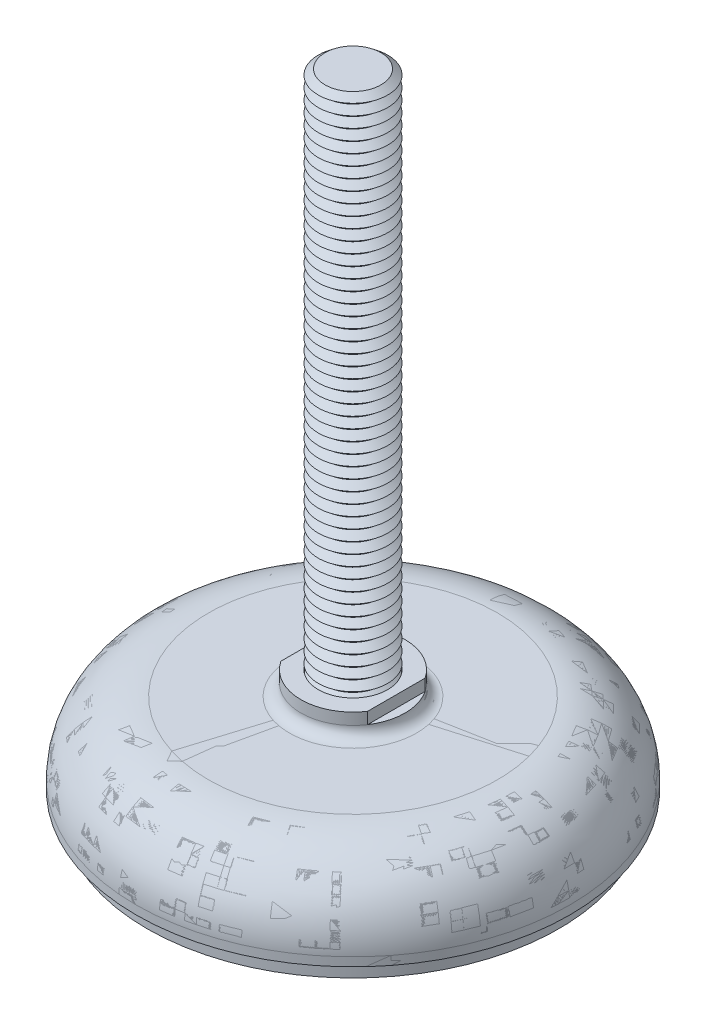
ISO-10303-21;
HEADER;
FILE_DESCRIPTION(('STEP AP214'),'2;1');
FILE_NAME('part.step','',(''),(''),'','','');
FILE_SCHEMA(('AUTOMOTIVE_DESIGN { 1 0 10303 214 1 1 1 1 }'));
ENDSEC;
DATA;
#1=APPLICATION_CONTEXT('core data for automotive mechanical design processes');
#2=APPLICATION_PROTOCOL_DEFINITION('international standard','automotive_design',2000,#1);
#3=PRODUCT_CONTEXT('',#1,'mechanical');
#4=PRODUCT('Part','Part','',(#3));
#5=PRODUCT_RELATED_PRODUCT_CATEGORY('part','',(#4));
#6=PRODUCT_DEFINITION_FORMATION('','',#4);
#7=PRODUCT_DEFINITION_CONTEXT('part definition',#1,'design');
#8=PRODUCT_DEFINITION('design','',#6,#7);
#9=PRODUCT_DEFINITION_SHAPE('','',#8);
#10=(LENGTH_UNIT() NAMED_UNIT(*) SI_UNIT(.MILLI.,.METRE.));
#11=(NAMED_UNIT(*) PLANE_ANGLE_UNIT() SI_UNIT($,.RADIAN.));
#12=(NAMED_UNIT(*) SI_UNIT($,.STERADIAN.) SOLID_ANGLE_UNIT());
#13=UNCERTAINTY_MEASURE_WITH_UNIT(LENGTH_MEASURE(1.E-05),#10,'distance_accuracy_value','');
#14=(GEOMETRIC_REPRESENTATION_CONTEXT(3) GLOBAL_UNCERTAINTY_ASSIGNED_CONTEXT((#13)) GLOBAL_UNIT_ASSIGNED_CONTEXT((#10,
#11,#12)) REPRESENTATION_CONTEXT('',''));
#15=CARTESIAN_POINT('',(0.,0.,0.));
#16=DIRECTION('',(0.,0.,1.));
#17=DIRECTION('',(1.,0.,0.));
#18=AXIS2_PLACEMENT_3D('',#15,#16,#17);
#19=CARTESIAN_POINT('',(0.,69.75,0.));
#20=DIRECTION('',(0.,-1.,0.));
#21=DIRECTION('',(0.998136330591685,0.,-0.0610234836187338));
#22=AXIS2_PLACEMENT_3D('',#19,#20,#21);
#23=CONICAL_SURFACE('',#22,3.2193752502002,0.895664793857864);
#24=CARTESIAN_POINT('',(0.,69.125,0.));
#25=DIRECTION('',(0.,-1.,0.));
#26=DIRECTION('',(0.998136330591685,0.,-0.0610234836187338));
#27=AXIS2_PLACEMENT_3D('',#24,#25,#26);
#28=CIRCLE('',#27,4.);
#29=CARTESIAN_POINT('',(3.99254532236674,69.125,-0.244093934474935));
#30=VERTEX_POINT('',#29);
#31=EDGE_CURVE('P0_E37',#30,#30,#28,.T.);
#32=ORIENTED_EDGE('',*,*,#31,.F.);
#33=EDGE_LOOP('',(#32));
#34=FACE_BOUND('',#33,.T.);
#35=CARTESIAN_POINT('',(0.,69.75,0.));
#36=DIRECTION('',(0.,-1.,0.));
#37=DIRECTION('',(0.998136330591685,0.,-0.0610234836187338));
#38=AXIS2_PLACEMENT_3D('',#35,#36,#37);
#39=CIRCLE('',#38,3.2193752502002);
#40=CARTESIAN_POINT('',(3.21337539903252,69.75,-0.196457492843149));
#41=VERTEX_POINT('',#40);
#42=EDGE_CURVE('P0_E25',#41,#41,#39,.T.);
#43=ORIENTED_EDGE('',*,*,#42,.T.);
#44=EDGE_LOOP('',(#43));
#45=FACE_BOUND('',#44,.T.);
#46=ADVANCED_FACE('P0_F14',(#34,#45),#23,.T.);
#47=CARTESIAN_POINT('',(0.,70.375,0.));
#48=DIRECTION('',(0.,1.,0.));
#49=DIRECTION('',(-0.998136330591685,0.,0.0610234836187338));
#50=AXIS2_PLACEMENT_3D('',#47,#48,#49);
#51=CONICAL_SURFACE('',#50,4.,0.895664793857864);
#52=ORIENTED_EDGE('',*,*,#42,.F.);
#53=EDGE_LOOP('',(#52));
#54=FACE_BOUND('',#53,.T.);
#55=CARTESIAN_POINT('',(0.,70.375,0.));
#56=DIRECTION('',(0.,-1.,0.));
#57=DIRECTION('',(0.998136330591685,0.,-0.0610234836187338));
#58=AXIS2_PLACEMENT_3D('',#55,#56,#57);
#59=CIRCLE('',#58,4.);
#60=CARTESIAN_POINT('',(3.99254532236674,70.375,-0.244093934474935));
#61=VERTEX_POINT('',#60);
#62=EDGE_CURVE('P0_E29',#61,#61,#59,.T.);
#63=ORIENTED_EDGE('',*,*,#62,.T.);
#64=EDGE_LOOP('',(#63));
#65=FACE_BOUND('',#64,.T.);
#66=ADVANCED_FACE('P0_F979',(#54,#65),#51,.T.);
#67=CARTESIAN_POINT('',(0.,71.,0.));
#68=DIRECTION('',(0.,1.,0.));
#69=DIRECTION('',(-0.998136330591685,0.,0.0610234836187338));
#70=AXIS2_PLACEMENT_3D('',#67,#68,#69);
#71=PLANE('',#70);
#72=CARTESIAN_POINT('',(0.,71.,0.));
#73=DIRECTION('',(0.,-1.,0.));
#74=DIRECTION('',(0.998136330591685,0.,-0.0610234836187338));
#75=AXIS2_PLACEMENT_3D('',#72,#73,#74);
#76=CIRCLE('',#75,3.2193752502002);
#77=CARTESIAN_POINT('',(3.21337539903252,71.,-0.196457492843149));
#78=VERTEX_POINT('',#77);
#79=EDGE_CURVE('P0_E21',#78,#78,#76,.T.);
#80=ORIENTED_EDGE('',*,*,#79,.F.);
#81=EDGE_LOOP('',(#80));
#82=FACE_BOUND('',#81,.T.);
#83=ADVANCED_FACE('P0_F985',(#82),#71,.T.);
#84=CARTESIAN_POINT('',(0.,71.,0.));
#85=DIRECTION('',(0.,-1.,0.));
#86=DIRECTION('',(0.998136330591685,0.,-0.0610234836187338));
#87=AXIS2_PLACEMENT_3D('',#84,#85,#86);
#88=CONICAL_SURFACE('',#87,3.2193752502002,0.895664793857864);
#89=ORIENTED_EDGE('',*,*,#62,.F.);
#90=EDGE_LOOP('',(#89));
#91=FACE_BOUND('',#90,.T.);
#92=ORIENTED_EDGE('',*,*,#79,.T.);
#93=EDGE_LOOP('',(#92));
#94=FACE_BOUND('',#93,.T.);
#95=ADVANCED_FACE('P0_F968',(#91,#94),#88,.T.);
#96=CARTESIAN_POINT('',(0.,68.5,0.));
#97=DIRECTION('',(0.,-1.,0.));
#98=DIRECTION('',(0.998136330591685,0.,-0.0610234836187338));
#99=AXIS2_PLACEMENT_3D('',#96,#97,#98);
#100=CONICAL_SURFACE('',#99,3.2193752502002,0.895664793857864);
#101=CARTESIAN_POINT('',(0.,67.875,0.));
#102=DIRECTION('',(0.,-1.,0.));
#103=DIRECTION('',(0.998136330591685,0.,-0.0610234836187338));
#104=AXIS2_PLACEMENT_3D('',#101,#102,#103);
#105=CIRCLE('',#104,4.);
#106=CARTESIAN_POINT('',(3.99254532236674,67.875,-0.244093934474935));
#107=VERTEX_POINT('',#106);
#108=EDGE_CURVE('P0_E43',#107,#107,#105,.T.);
#109=ORIENTED_EDGE('',*,*,#108,.F.);
#110=EDGE_LOOP('',(#109));
#111=FACE_BOUND('',#110,.T.);
#112=CARTESIAN_POINT('',(0.,68.5,0.));
#113=DIRECTION('',(0.,-1.,0.));
#114=DIRECTION('',(0.998136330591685,0.,-0.0610234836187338));
#115=AXIS2_PLACEMENT_3D('',#112,#113,#114);
#116=CIRCLE('',#115,3.2193752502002);
#117=CARTESIAN_POINT('',(3.21337539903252,68.5,-0.196457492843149));
#118=VERTEX_POINT('',#117);
#119=EDGE_CURVE('P0_E34',#118,#118,#116,.T.);
#120=ORIENTED_EDGE('',*,*,#119,.T.);
#121=EDGE_LOOP('',(#120));
#122=FACE_BOUND('',#121,.T.);
#123=ADVANCED_FACE('P0_F965',(#111,#122),#100,.T.);
#124=CARTESIAN_POINT('',(0.,69.125,0.));
#125=DIRECTION('',(0.,1.,0.));
#126=DIRECTION('',(-0.998136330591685,0.,0.0610234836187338));
#127=AXIS2_PLACEMENT_3D('',#124,#125,#126);
#128=CONICAL_SURFACE('',#127,4.,0.895664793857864);
#129=ORIENTED_EDGE('',*,*,#119,.F.);
#130=EDGE_LOOP('',(#129));
#131=FACE_BOUND('',#130,.T.);
#132=ORIENTED_EDGE('',*,*,#31,.T.);
#133=EDGE_LOOP('',(#132));
#134=FACE_BOUND('',#133,.T.);
#135=ADVANCED_FACE('P0_F956',(#131,#134),#128,.T.);
#136=CARTESIAN_POINT('',(0.,67.25,0.));
#137=DIRECTION('',(0.,-1.,0.));
#138=DIRECTION('',(0.998136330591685,0.,-0.0610234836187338));
#139=AXIS2_PLACEMENT_3D('',#136,#137,#138);
#140=CONICAL_SURFACE('',#139,3.2193752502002,0.895664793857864);
#141=CARTESIAN_POINT('',(0.,66.625,0.));
#142=DIRECTION('',(0.,-1.,0.));
#143=DIRECTION('',(0.998136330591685,0.,-0.0610234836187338));
#144=AXIS2_PLACEMENT_3D('',#141,#142,#143);
#145=CIRCLE('',#144,4.);
#146=CARTESIAN_POINT('',(3.99254532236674,66.625,-0.244093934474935));
#147=VERTEX_POINT('',#146);
#148=EDGE_CURVE('P0_E49',#147,#147,#145,.T.);
#149=ORIENTED_EDGE('',*,*,#148,.F.);
#150=EDGE_LOOP('',(#149));
#151=FACE_BOUND('',#150,.T.);
#152=CARTESIAN_POINT('',(0.,67.25,0.));
#153=DIRECTION('',(0.,-1.,0.));
#154=DIRECTION('',(0.998136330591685,0.,-0.0610234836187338));
#155=AXIS2_PLACEMENT_3D('',#152,#153,#154);
#156=CIRCLE('',#155,3.2193752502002);
#157=CARTESIAN_POINT('',(3.21337539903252,67.25,-0.196457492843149));
#158=VERTEX_POINT('',#157);
#159=EDGE_CURVE('P0_E40',#158,#158,#156,.T.);
#160=ORIENTED_EDGE('',*,*,#159,.T.);
#161=EDGE_LOOP('',(#160));
#162=FACE_BOUND('',#161,.T.);
#163=ADVANCED_FACE('P0_F953',(#151,#162),#140,.T.);
#164=CARTESIAN_POINT('',(0.,67.875,0.));
#165=DIRECTION('',(0.,1.,0.));
#166=DIRECTION('',(-0.998136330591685,0.,0.0610234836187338));
#167=AXIS2_PLACEMENT_3D('',#164,#165,#166);
#168=CONICAL_SURFACE('',#167,4.,0.895664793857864);
#169=ORIENTED_EDGE('',*,*,#159,.F.);
#170=EDGE_LOOP('',(#169));
#171=FACE_BOUND('',#170,.T.);
#172=ORIENTED_EDGE('',*,*,#108,.T.);
#173=EDGE_LOOP('',(#172));
#174=FACE_BOUND('',#173,.T.);
#175=ADVANCED_FACE('P0_F944',(#171,#174),#168,.T.);
#176=CARTESIAN_POINT('',(0.,66.,0.));
#177=DIRECTION('',(0.,-1.,0.));
#178=DIRECTION('',(0.998136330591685,0.,-0.0610234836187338));
#179=AXIS2_PLACEMENT_3D('',#176,#177,#178);
#180=CONICAL_SURFACE('',#179,3.2193752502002,0.895664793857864);
#181=CARTESIAN_POINT('',(0.,65.375,0.));
#182=DIRECTION('',(0.,-1.,0.));
#183=DIRECTION('',(0.998136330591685,0.,-0.0610234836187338));
#184=AXIS2_PLACEMENT_3D('',#181,#182,#183);
#185=CIRCLE('',#184,4.);
#186=CARTESIAN_POINT('',(3.99254532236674,65.375,-0.244093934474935));
#187=VERTEX_POINT('',#186);
#188=EDGE_CURVE('P0_E55',#187,#187,#185,.T.);
#189=ORIENTED_EDGE('',*,*,#188,.F.);
#190=EDGE_LOOP('',(#189));
#191=FACE_BOUND('',#190,.T.);
#192=CARTESIAN_POINT('',(0.,66.,0.));
#193=DIRECTION('',(0.,-1.,0.));
#194=DIRECTION('',(0.998136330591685,0.,-0.0610234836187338));
#195=AXIS2_PLACEMENT_3D('',#192,#193,#194);
#196=CIRCLE('',#195,3.2193752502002);
#197=CARTESIAN_POINT('',(3.21337539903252,66.,-0.196457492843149));
#198=VERTEX_POINT('',#197);
#199=EDGE_CURVE('P0_E46',#198,#198,#196,.T.);
#200=ORIENTED_EDGE('',*,*,#199,.T.);
#201=EDGE_LOOP('',(#200));
#202=FACE_BOUND('',#201,.T.);
#203=ADVANCED_FACE('P0_F941',(#191,#202),#180,.T.);
#204=CARTESIAN_POINT('',(0.,66.625,0.));
#205=DIRECTION('',(0.,1.,0.));
#206=DIRECTION('',(-0.998136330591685,0.,0.0610234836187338));
#207=AXIS2_PLACEMENT_3D('',#204,#205,#206);
#208=CONICAL_SURFACE('',#207,4.,0.895664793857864);
#209=ORIENTED_EDGE('',*,*,#199,.F.);
#210=EDGE_LOOP('',(#209));
#211=FACE_BOUND('',#210,.T.);
#212=ORIENTED_EDGE('',*,*,#148,.T.);
#213=EDGE_LOOP('',(#212));
#214=FACE_BOUND('',#213,.T.);
#215=ADVANCED_FACE('P0_F932',(#211,#214),#208,.T.);
#216=CARTESIAN_POINT('',(0.,64.75,0.));
#217=DIRECTION('',(0.,-1.,0.));
#218=DIRECTION('',(0.998136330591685,0.,-0.0610234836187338));
#219=AXIS2_PLACEMENT_3D('',#216,#217,#218);
#220=CONICAL_SURFACE('',#219,3.2193752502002,0.895664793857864);
#221=CARTESIAN_POINT('',(0.,64.125,0.));
#222=DIRECTION('',(0.,-1.,0.));
#223=DIRECTION('',(0.998136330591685,0.,-0.0610234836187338));
#224=AXIS2_PLACEMENT_3D('',#221,#222,#223);
#225=CIRCLE('',#224,4.);
#226=CARTESIAN_POINT('',(3.99254532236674,64.125,-0.244093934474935));
#227=VERTEX_POINT('',#226);
#228=EDGE_CURVE('P0_E61',#227,#227,#225,.T.);
#229=ORIENTED_EDGE('',*,*,#228,.F.);
#230=EDGE_LOOP('',(#229));
#231=FACE_BOUND('',#230,.T.);
#232=CARTESIAN_POINT('',(0.,64.75,0.));
#233=DIRECTION('',(0.,-1.,0.));
#234=DIRECTION('',(0.998136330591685,0.,-0.0610234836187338));
#235=AXIS2_PLACEMENT_3D('',#232,#233,#234);
#236=CIRCLE('',#235,3.2193752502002);
#237=CARTESIAN_POINT('',(3.21337539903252,64.75,-0.196457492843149));
#238=VERTEX_POINT('',#237);
#239=EDGE_CURVE('P0_E52',#238,#238,#236,.T.);
#240=ORIENTED_EDGE('',*,*,#239,.T.);
#241=EDGE_LOOP('',(#240));
#242=FACE_BOUND('',#241,.T.);
#243=ADVANCED_FACE('P0_F929',(#231,#242),#220,.T.);
#244=CARTESIAN_POINT('',(0.,65.375,0.));
#245=DIRECTION('',(0.,1.,0.));
#246=DIRECTION('',(-0.998136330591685,0.,0.0610234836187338));
#247=AXIS2_PLACEMENT_3D('',#244,#245,#246);
#248=CONICAL_SURFACE('',#247,4.,0.895664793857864);
#249=ORIENTED_EDGE('',*,*,#239,.F.);
#250=EDGE_LOOP('',(#249));
#251=FACE_BOUND('',#250,.T.);
#252=ORIENTED_EDGE('',*,*,#188,.T.);
#253=EDGE_LOOP('',(#252));
#254=FACE_BOUND('',#253,.T.);
#255=ADVANCED_FACE('P0_F920',(#251,#254),#248,.T.);
#256=CARTESIAN_POINT('',(0.,63.5,0.));
#257=DIRECTION('',(0.,-1.,0.));
#258=DIRECTION('',(0.998136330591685,0.,-0.0610234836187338));
#259=AXIS2_PLACEMENT_3D('',#256,#257,#258);
#260=CONICAL_SURFACE('',#259,3.2193752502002,0.895664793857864);
#261=CARTESIAN_POINT('',(0.,62.875,0.));
#262=DIRECTION('',(0.,-1.,0.));
#263=DIRECTION('',(0.998136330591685,0.,-0.0610234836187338));
#264=AXIS2_PLACEMENT_3D('',#261,#262,#263);
#265=CIRCLE('',#264,4.);
#266=CARTESIAN_POINT('',(3.99254532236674,62.875,-0.244093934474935));
#267=VERTEX_POINT('',#266);
#268=EDGE_CURVE('P0_E67',#267,#267,#265,.T.);
#269=ORIENTED_EDGE('',*,*,#268,.F.);
#270=EDGE_LOOP('',(#269));
#271=FACE_BOUND('',#270,.T.);
#272=CARTESIAN_POINT('',(0.,63.5,0.));
#273=DIRECTION('',(0.,-1.,0.));
#274=DIRECTION('',(0.998136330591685,0.,-0.0610234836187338));
#275=AXIS2_PLACEMENT_3D('',#272,#273,#274);
#276=CIRCLE('',#275,3.2193752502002);
#277=CARTESIAN_POINT('',(3.21337539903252,63.5,-0.196457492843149));
#278=VERTEX_POINT('',#277);
#279=EDGE_CURVE('P0_E58',#278,#278,#276,.T.);
#280=ORIENTED_EDGE('',*,*,#279,.T.);
#281=EDGE_LOOP('',(#280));
#282=FACE_BOUND('',#281,.T.);
#283=ADVANCED_FACE('P0_F917',(#271,#282),#260,.T.);
#284=CARTESIAN_POINT('',(0.,64.125,0.));
#285=DIRECTION('',(0.,1.,0.));
#286=DIRECTION('',(-0.998136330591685,0.,0.0610234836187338));
#287=AXIS2_PLACEMENT_3D('',#284,#285,#286);
#288=CONICAL_SURFACE('',#287,4.,0.895664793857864);
#289=ORIENTED_EDGE('',*,*,#279,.F.);
#290=EDGE_LOOP('',(#289));
#291=FACE_BOUND('',#290,.T.);
#292=ORIENTED_EDGE('',*,*,#228,.T.);
#293=EDGE_LOOP('',(#292));
#294=FACE_BOUND('',#293,.T.);
#295=ADVANCED_FACE('P0_F908',(#291,#294),#288,.T.);
#296=CARTESIAN_POINT('',(0.,62.25,0.));
#297=DIRECTION('',(0.,-1.,0.));
#298=DIRECTION('',(0.998136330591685,0.,-0.0610234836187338));
#299=AXIS2_PLACEMENT_3D('',#296,#297,#298);
#300=CONICAL_SURFACE('',#299,3.2193752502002,0.895664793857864);
#301=CARTESIAN_POINT('',(0.,61.625,0.));
#302=DIRECTION('',(0.,-1.,0.));
#303=DIRECTION('',(0.998136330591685,0.,-0.0610234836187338));
#304=AXIS2_PLACEMENT_3D('',#301,#302,#303);
#305=CIRCLE('',#304,4.);
#306=CARTESIAN_POINT('',(3.99254532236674,61.625,-0.244093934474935));
#307=VERTEX_POINT('',#306);
#308=EDGE_CURVE('P0_E73',#307,#307,#305,.T.);
#309=ORIENTED_EDGE('',*,*,#308,.F.);
#310=EDGE_LOOP('',(#309));
#311=FACE_BOUND('',#310,.T.);
#312=CARTESIAN_POINT('',(0.,62.25,0.));
#313=DIRECTION('',(0.,-1.,0.));
#314=DIRECTION('',(0.998136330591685,0.,-0.0610234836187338));
#315=AXIS2_PLACEMENT_3D('',#312,#313,#314);
#316=CIRCLE('',#315,3.2193752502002);
#317=CARTESIAN_POINT('',(3.21337539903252,62.25,-0.196457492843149));
#318=VERTEX_POINT('',#317);
#319=EDGE_CURVE('P0_E64',#318,#318,#316,.T.);
#320=ORIENTED_EDGE('',*,*,#319,.T.);
#321=EDGE_LOOP('',(#320));
#322=FACE_BOUND('',#321,.T.);
#323=ADVANCED_FACE('P0_F905',(#311,#322),#300,.T.);
#324=CARTESIAN_POINT('',(0.,62.875,0.));
#325=DIRECTION('',(0.,1.,0.));
#326=DIRECTION('',(-0.998136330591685,0.,0.0610234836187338));
#327=AXIS2_PLACEMENT_3D('',#324,#325,#326);
#328=CONICAL_SURFACE('',#327,4.,0.895664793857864);
#329=ORIENTED_EDGE('',*,*,#319,.F.);
#330=EDGE_LOOP('',(#329));
#331=FACE_BOUND('',#330,.T.);
#332=ORIENTED_EDGE('',*,*,#268,.T.);
#333=EDGE_LOOP('',(#332));
#334=FACE_BOUND('',#333,.T.);
#335=ADVANCED_FACE('P0_F896',(#331,#334),#328,.T.);
#336=CARTESIAN_POINT('',(0.,61.,0.));
#337=DIRECTION('',(0.,-1.,0.));
#338=DIRECTION('',(0.998136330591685,0.,-0.0610234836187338));
#339=AXIS2_PLACEMENT_3D('',#336,#337,#338);
#340=CONICAL_SURFACE('',#339,3.2193752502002,0.895664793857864);
#341=CARTESIAN_POINT('',(0.,60.375,0.));
#342=DIRECTION('',(0.,-1.,0.));
#343=DIRECTION('',(0.998136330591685,0.,-0.0610234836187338));
#344=AXIS2_PLACEMENT_3D('',#341,#342,#343);
#345=CIRCLE('',#344,4.);
#346=CARTESIAN_POINT('',(3.99254532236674,60.375,-0.244093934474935));
#347=VERTEX_POINT('',#346);
#348=EDGE_CURVE('P0_E79',#347,#347,#345,.T.);
#349=ORIENTED_EDGE('',*,*,#348,.F.);
#350=EDGE_LOOP('',(#349));
#351=FACE_BOUND('',#350,.T.);
#352=CARTESIAN_POINT('',(0.,61.,0.));
#353=DIRECTION('',(0.,-1.,0.));
#354=DIRECTION('',(0.998136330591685,0.,-0.0610234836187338));
#355=AXIS2_PLACEMENT_3D('',#352,#353,#354);
#356=CIRCLE('',#355,3.2193752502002);
#357=CARTESIAN_POINT('',(3.21337539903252,61.,-0.196457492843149));
#358=VERTEX_POINT('',#357);
#359=EDGE_CURVE('P0_E70',#358,#358,#356,.T.);
#360=ORIENTED_EDGE('',*,*,#359,.T.);
#361=EDGE_LOOP('',(#360));
#362=FACE_BOUND('',#361,.T.);
#363=ADVANCED_FACE('P0_F893',(#351,#362),#340,.T.);
#364=CARTESIAN_POINT('',(0.,61.625,0.));
#365=DIRECTION('',(0.,1.,0.));
#366=DIRECTION('',(-0.998136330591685,0.,0.0610234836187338));
#367=AXIS2_PLACEMENT_3D('',#364,#365,#366);
#368=CONICAL_SURFACE('',#367,4.,0.895664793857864);
#369=ORIENTED_EDGE('',*,*,#359,.F.);
#370=EDGE_LOOP('',(#369));
#371=FACE_BOUND('',#370,.T.);
#372=ORIENTED_EDGE('',*,*,#308,.T.);
#373=EDGE_LOOP('',(#372));
#374=FACE_BOUND('',#373,.T.);
#375=ADVANCED_FACE('P0_F884',(#371,#374),#368,.T.);
#376=CARTESIAN_POINT('',(0.,59.75,0.));
#377=DIRECTION('',(0.,-1.,0.));
#378=DIRECTION('',(0.998136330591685,0.,-0.0610234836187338));
#379=AXIS2_PLACEMENT_3D('',#376,#377,#378);
#380=CONICAL_SURFACE('',#379,3.2193752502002,0.895664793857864);
#381=CARTESIAN_POINT('',(0.,59.125,0.));
#382=DIRECTION('',(0.,-1.,0.));
#383=DIRECTION('',(0.998136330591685,0.,-0.0610234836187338));
#384=AXIS2_PLACEMENT_3D('',#381,#382,#383);
#385=CIRCLE('',#384,4.);
#386=CARTESIAN_POINT('',(3.99254532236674,59.125,-0.244093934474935));
#387=VERTEX_POINT('',#386);
#388=EDGE_CURVE('P0_E85',#387,#387,#385,.T.);
#389=ORIENTED_EDGE('',*,*,#388,.F.);
#390=EDGE_LOOP('',(#389));
#391=FACE_BOUND('',#390,.T.);
#392=CARTESIAN_POINT('',(0.,59.75,0.));
#393=DIRECTION('',(0.,-1.,0.));
#394=DIRECTION('',(0.998136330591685,0.,-0.0610234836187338));
#395=AXIS2_PLACEMENT_3D('',#392,#393,#394);
#396=CIRCLE('',#395,3.2193752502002);
#397=CARTESIAN_POINT('',(3.21337539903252,59.75,-0.196457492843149));
#398=VERTEX_POINT('',#397);
#399=EDGE_CURVE('P0_E76',#398,#398,#396,.T.);
#400=ORIENTED_EDGE('',*,*,#399,.T.);
#401=EDGE_LOOP('',(#400));
#402=FACE_BOUND('',#401,.T.);
#403=ADVANCED_FACE('P0_F881',(#391,#402),#380,.T.);
#404=CARTESIAN_POINT('',(0.,60.375,0.));
#405=DIRECTION('',(0.,1.,0.));
#406=DIRECTION('',(-0.998136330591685,0.,0.0610234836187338));
#407=AXIS2_PLACEMENT_3D('',#404,#405,#406);
#408=CONICAL_SURFACE('',#407,4.,0.895664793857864);
#409=ORIENTED_EDGE('',*,*,#399,.F.);
#410=EDGE_LOOP('',(#409));
#411=FACE_BOUND('',#410,.T.);
#412=ORIENTED_EDGE('',*,*,#348,.T.);
#413=EDGE_LOOP('',(#412));
#414=FACE_BOUND('',#413,.T.);
#415=ADVANCED_FACE('P0_F872',(#411,#414),#408,.T.);
#416=CARTESIAN_POINT('',(0.,58.5,0.));
#417=DIRECTION('',(0.,-1.,0.));
#418=DIRECTION('',(0.998136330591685,0.,-0.0610234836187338));
#419=AXIS2_PLACEMENT_3D('',#416,#417,#418);
#420=CONICAL_SURFACE('',#419,3.2193752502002,0.895664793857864);
#421=CARTESIAN_POINT('',(0.,57.875,0.));
#422=DIRECTION('',(0.,-1.,0.));
#423=DIRECTION('',(0.998136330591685,0.,-0.0610234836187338));
#424=AXIS2_PLACEMENT_3D('',#421,#422,#423);
#425=CIRCLE('',#424,4.);
#426=CARTESIAN_POINT('',(3.99254532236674,57.875,-0.244093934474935));
#427=VERTEX_POINT('',#426);
#428=EDGE_CURVE('P0_E91',#427,#427,#425,.T.);
#429=ORIENTED_EDGE('',*,*,#428,.F.);
#430=EDGE_LOOP('',(#429));
#431=FACE_BOUND('',#430,.T.);
#432=CARTESIAN_POINT('',(0.,58.5,0.));
#433=DIRECTION('',(0.,-1.,0.));
#434=DIRECTION('',(0.998136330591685,0.,-0.0610234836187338));
#435=AXIS2_PLACEMENT_3D('',#432,#433,#434);
#436=CIRCLE('',#435,3.2193752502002);
#437=CARTESIAN_POINT('',(3.21337539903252,58.5,-0.196457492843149));
#438=VERTEX_POINT('',#437);
#439=EDGE_CURVE('P0_E82',#438,#438,#436,.T.);
#440=ORIENTED_EDGE('',*,*,#439,.T.);
#441=EDGE_LOOP('',(#440));
#442=FACE_BOUND('',#441,.T.);
#443=ADVANCED_FACE('P0_F869',(#431,#442),#420,.T.);
#444=CARTESIAN_POINT('',(0.,59.125,0.));
#445=DIRECTION('',(0.,1.,0.));
#446=DIRECTION('',(-0.998136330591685,0.,0.0610234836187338));
#447=AXIS2_PLACEMENT_3D('',#444,#445,#446);
#448=CONICAL_SURFACE('',#447,4.,0.895664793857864);
#449=ORIENTED_EDGE('',*,*,#439,.F.);
#450=EDGE_LOOP('',(#449));
#451=FACE_BOUND('',#450,.T.);
#452=ORIENTED_EDGE('',*,*,#388,.T.);
#453=EDGE_LOOP('',(#452));
#454=FACE_BOUND('',#453,.T.);
#455=ADVANCED_FACE('P0_F860',(#451,#454),#448,.T.);
#456=CARTESIAN_POINT('',(0.,57.25,0.));
#457=DIRECTION('',(0.,-1.,0.));
#458=DIRECTION('',(0.998136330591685,0.,-0.0610234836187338));
#459=AXIS2_PLACEMENT_3D('',#456,#457,#458);
#460=CONICAL_SURFACE('',#459,3.2193752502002,0.895664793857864);
#461=CARTESIAN_POINT('',(0.,56.625,0.));
#462=DIRECTION('',(0.,-1.,0.));
#463=DIRECTION('',(0.998136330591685,0.,-0.0610234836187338));
#464=AXIS2_PLACEMENT_3D('',#461,#462,#463);
#465=CIRCLE('',#464,4.);
#466=CARTESIAN_POINT('',(3.99254532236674,56.625,-0.244093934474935));
#467=VERTEX_POINT('',#466);
#468=EDGE_CURVE('P0_E97',#467,#467,#465,.T.);
#469=ORIENTED_EDGE('',*,*,#468,.F.);
#470=EDGE_LOOP('',(#469));
#471=FACE_BOUND('',#470,.T.);
#472=CARTESIAN_POINT('',(0.,57.25,0.));
#473=DIRECTION('',(0.,-1.,0.));
#474=DIRECTION('',(0.998136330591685,0.,-0.0610234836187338));
#475=AXIS2_PLACEMENT_3D('',#472,#473,#474);
#476=CIRCLE('',#475,3.2193752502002);
#477=CARTESIAN_POINT('',(3.21337539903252,57.25,-0.196457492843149));
#478=VERTEX_POINT('',#477);
#479=EDGE_CURVE('P0_E88',#478,#478,#476,.T.);
#480=ORIENTED_EDGE('',*,*,#479,.T.);
#481=EDGE_LOOP('',(#480));
#482=FACE_BOUND('',#481,.T.);
#483=ADVANCED_FACE('P0_F857',(#471,#482),#460,.T.);
#484=CARTESIAN_POINT('',(0.,57.875,0.));
#485=DIRECTION('',(0.,1.,0.));
#486=DIRECTION('',(-0.998136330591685,0.,0.0610234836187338));
#487=AXIS2_PLACEMENT_3D('',#484,#485,#486);
#488=CONICAL_SURFACE('',#487,4.,0.895664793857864);
#489=ORIENTED_EDGE('',*,*,#479,.F.);
#490=EDGE_LOOP('',(#489));
#491=FACE_BOUND('',#490,.T.);
#492=ORIENTED_EDGE('',*,*,#428,.T.);
#493=EDGE_LOOP('',(#492));
#494=FACE_BOUND('',#493,.T.);
#495=ADVANCED_FACE('P0_F848',(#491,#494),#488,.T.);
#496=CARTESIAN_POINT('',(0.,56.,0.));
#497=DIRECTION('',(0.,-1.,0.));
#498=DIRECTION('',(0.998136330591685,0.,-0.0610234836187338));
#499=AXIS2_PLACEMENT_3D('',#496,#497,#498);
#500=CONICAL_SURFACE('',#499,3.2193752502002,0.895664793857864);
#501=CARTESIAN_POINT('',(0.,55.375,0.));
#502=DIRECTION('',(0.,-1.,0.));
#503=DIRECTION('',(0.998136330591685,0.,-0.0610234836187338));
#504=AXIS2_PLACEMENT_3D('',#501,#502,#503);
#505=CIRCLE('',#504,4.);
#506=CARTESIAN_POINT('',(3.99254532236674,55.375,-0.244093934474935));
#507=VERTEX_POINT('',#506);
#508=EDGE_CURVE('P0_E103',#507,#507,#505,.T.);
#509=ORIENTED_EDGE('',*,*,#508,.F.);
#510=EDGE_LOOP('',(#509));
#511=FACE_BOUND('',#510,.T.);
#512=CARTESIAN_POINT('',(0.,56.,0.));
#513=DIRECTION('',(0.,-1.,0.));
#514=DIRECTION('',(0.998136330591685,0.,-0.0610234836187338));
#515=AXIS2_PLACEMENT_3D('',#512,#513,#514);
#516=CIRCLE('',#515,3.2193752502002);
#517=CARTESIAN_POINT('',(3.21337539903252,56.,-0.196457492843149));
#518=VERTEX_POINT('',#517);
#519=EDGE_CURVE('P0_E94',#518,#518,#516,.T.);
#520=ORIENTED_EDGE('',*,*,#519,.T.);
#521=EDGE_LOOP('',(#520));
#522=FACE_BOUND('',#521,.T.);
#523=ADVANCED_FACE('P0_F845',(#511,#522),#500,.T.);
#524=CARTESIAN_POINT('',(0.,56.625,0.));
#525=DIRECTION('',(0.,1.,0.));
#526=DIRECTION('',(-0.998136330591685,0.,0.0610234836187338));
#527=AXIS2_PLACEMENT_3D('',#524,#525,#526);
#528=CONICAL_SURFACE('',#527,4.,0.895664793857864);
#529=ORIENTED_EDGE('',*,*,#519,.F.);
#530=EDGE_LOOP('',(#529));
#531=FACE_BOUND('',#530,.T.);
#532=ORIENTED_EDGE('',*,*,#468,.T.);
#533=EDGE_LOOP('',(#532));
#534=FACE_BOUND('',#533,.T.);
#535=ADVANCED_FACE('P0_F836',(#531,#534),#528,.T.);
#536=CARTESIAN_POINT('',(0.,54.75,0.));
#537=DIRECTION('',(0.,-1.,0.));
#538=DIRECTION('',(0.998136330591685,0.,-0.0610234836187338));
#539=AXIS2_PLACEMENT_3D('',#536,#537,#538);
#540=CONICAL_SURFACE('',#539,3.2193752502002,0.895664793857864);
#541=CARTESIAN_POINT('',(0.,54.125,0.));
#542=DIRECTION('',(0.,-1.,0.));
#543=DIRECTION('',(0.998136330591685,0.,-0.0610234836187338));
#544=AXIS2_PLACEMENT_3D('',#541,#542,#543);
#545=CIRCLE('',#544,4.);
#546=CARTESIAN_POINT('',(3.99254532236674,54.125,-0.244093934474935));
#547=VERTEX_POINT('',#546);
#548=EDGE_CURVE('P0_E109',#547,#547,#545,.T.);
#549=ORIENTED_EDGE('',*,*,#548,.F.);
#550=EDGE_LOOP('',(#549));
#551=FACE_BOUND('',#550,.T.);
#552=CARTESIAN_POINT('',(0.,54.75,0.));
#553=DIRECTION('',(0.,-1.,0.));
#554=DIRECTION('',(0.998136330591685,0.,-0.0610234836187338));
#555=AXIS2_PLACEMENT_3D('',#552,#553,#554);
#556=CIRCLE('',#555,3.2193752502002);
#557=CARTESIAN_POINT('',(3.21337539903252,54.75,-0.196457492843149));
#558=VERTEX_POINT('',#557);
#559=EDGE_CURVE('P0_E100',#558,#558,#556,.T.);
#560=ORIENTED_EDGE('',*,*,#559,.T.);
#561=EDGE_LOOP('',(#560));
#562=FACE_BOUND('',#561,.T.);
#563=ADVANCED_FACE('P0_F833',(#551,#562),#540,.T.);
#564=CARTESIAN_POINT('',(0.,55.375,0.));
#565=DIRECTION('',(0.,1.,0.));
#566=DIRECTION('',(-0.998136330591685,0.,0.0610234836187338));
#567=AXIS2_PLACEMENT_3D('',#564,#565,#566);
#568=CONICAL_SURFACE('',#567,4.,0.895664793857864);
#569=ORIENTED_EDGE('',*,*,#559,.F.);
#570=EDGE_LOOP('',(#569));
#571=FACE_BOUND('',#570,.T.);
#572=ORIENTED_EDGE('',*,*,#508,.T.);
#573=EDGE_LOOP('',(#572));
#574=FACE_BOUND('',#573,.T.);
#575=ADVANCED_FACE('P0_F824',(#571,#574),#568,.T.);
#576=CARTESIAN_POINT('',(0.,53.5,0.));
#577=DIRECTION('',(0.,-1.,0.));
#578=DIRECTION('',(0.998136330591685,0.,-0.0610234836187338));
#579=AXIS2_PLACEMENT_3D('',#576,#577,#578);
#580=CONICAL_SURFACE('',#579,3.2193752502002,0.895664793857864);
#581=CARTESIAN_POINT('',(0.,52.875,0.));
#582=DIRECTION('',(0.,-1.,0.));
#583=DIRECTION('',(0.998136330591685,0.,-0.0610234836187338));
#584=AXIS2_PLACEMENT_3D('',#581,#582,#583);
#585=CIRCLE('',#584,4.);
#586=CARTESIAN_POINT('',(3.99254532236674,52.875,-0.244093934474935));
#587=VERTEX_POINT('',#586);
#588=EDGE_CURVE('P0_E115',#587,#587,#585,.T.);
#589=ORIENTED_EDGE('',*,*,#588,.F.);
#590=EDGE_LOOP('',(#589));
#591=FACE_BOUND('',#590,.T.);
#592=CARTESIAN_POINT('',(0.,53.5,0.));
#593=DIRECTION('',(0.,-1.,0.));
#594=DIRECTION('',(0.998136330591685,0.,-0.0610234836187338));
#595=AXIS2_PLACEMENT_3D('',#592,#593,#594);
#596=CIRCLE('',#595,3.2193752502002);
#597=CARTESIAN_POINT('',(3.21337539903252,53.5,-0.196457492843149));
#598=VERTEX_POINT('',#597);
#599=EDGE_CURVE('P0_E106',#598,#598,#596,.T.);
#600=ORIENTED_EDGE('',*,*,#599,.T.);
#601=EDGE_LOOP('',(#600));
#602=FACE_BOUND('',#601,.T.);
#603=ADVANCED_FACE('P0_F821',(#591,#602),#580,.T.);
#604=CARTESIAN_POINT('',(0.,54.125,0.));
#605=DIRECTION('',(0.,1.,0.));
#606=DIRECTION('',(-0.998136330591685,0.,0.0610234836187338));
#607=AXIS2_PLACEMENT_3D('',#604,#605,#606);
#608=CONICAL_SURFACE('',#607,4.,0.895664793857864);
#609=ORIENTED_EDGE('',*,*,#599,.F.);
#610=EDGE_LOOP('',(#609));
#611=FACE_BOUND('',#610,.T.);
#612=ORIENTED_EDGE('',*,*,#548,.T.);
#613=EDGE_LOOP('',(#612));
#614=FACE_BOUND('',#613,.T.);
#615=ADVANCED_FACE('P0_F812',(#611,#614),#608,.T.);
#616=CARTESIAN_POINT('',(0.,52.25,0.));
#617=DIRECTION('',(0.,-1.,0.));
#618=DIRECTION('',(0.998136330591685,0.,-0.0610234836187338));
#619=AXIS2_PLACEMENT_3D('',#616,#617,#618);
#620=CONICAL_SURFACE('',#619,3.2193752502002,0.895664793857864);
#621=CARTESIAN_POINT('',(0.,51.625,0.));
#622=DIRECTION('',(0.,-1.,0.));
#623=DIRECTION('',(0.998136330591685,0.,-0.0610234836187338));
#624=AXIS2_PLACEMENT_3D('',#621,#622,#623);
#625=CIRCLE('',#624,4.);
#626=CARTESIAN_POINT('',(3.99254532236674,51.625,-0.244093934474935));
#627=VERTEX_POINT('',#626);
#628=EDGE_CURVE('P0_E121',#627,#627,#625,.T.);
#629=ORIENTED_EDGE('',*,*,#628,.F.);
#630=EDGE_LOOP('',(#629));
#631=FACE_BOUND('',#630,.T.);
#632=CARTESIAN_POINT('',(0.,52.25,0.));
#633=DIRECTION('',(0.,-1.,0.));
#634=DIRECTION('',(0.998136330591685,0.,-0.0610234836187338));
#635=AXIS2_PLACEMENT_3D('',#632,#633,#634);
#636=CIRCLE('',#635,3.2193752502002);
#637=CARTESIAN_POINT('',(3.21337539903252,52.25,-0.196457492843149));
#638=VERTEX_POINT('',#637);
#639=EDGE_CURVE('P0_E112',#638,#638,#636,.T.);
#640=ORIENTED_EDGE('',*,*,#639,.T.);
#641=EDGE_LOOP('',(#640));
#642=FACE_BOUND('',#641,.T.);
#643=ADVANCED_FACE('P0_F809',(#631,#642),#620,.T.);
#644=CARTESIAN_POINT('',(0.,52.875,0.));
#645=DIRECTION('',(0.,1.,0.));
#646=DIRECTION('',(-0.998136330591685,0.,0.0610234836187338));
#647=AXIS2_PLACEMENT_3D('',#644,#645,#646);
#648=CONICAL_SURFACE('',#647,4.,0.895664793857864);
#649=ORIENTED_EDGE('',*,*,#639,.F.);
#650=EDGE_LOOP('',(#649));
#651=FACE_BOUND('',#650,.T.);
#652=ORIENTED_EDGE('',*,*,#588,.T.);
#653=EDGE_LOOP('',(#652));
#654=FACE_BOUND('',#653,.T.);
#655=ADVANCED_FACE('P0_F800',(#651,#654),#648,.T.);
#656=CARTESIAN_POINT('',(0.,51.,0.));
#657=DIRECTION('',(0.,-1.,0.));
#658=DIRECTION('',(0.998136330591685,0.,-0.0610234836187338));
#659=AXIS2_PLACEMENT_3D('',#656,#657,#658);
#660=CONICAL_SURFACE('',#659,3.2193752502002,0.895664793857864);
#661=CARTESIAN_POINT('',(0.,50.375,0.));
#662=DIRECTION('',(0.,-1.,0.));
#663=DIRECTION('',(0.998136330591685,0.,-0.0610234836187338));
#664=AXIS2_PLACEMENT_3D('',#661,#662,#663);
#665=CIRCLE('',#664,4.);
#666=CARTESIAN_POINT('',(3.99254532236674,50.375,-0.244093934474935));
#667=VERTEX_POINT('',#666);
#668=EDGE_CURVE('P0_E127',#667,#667,#665,.T.);
#669=ORIENTED_EDGE('',*,*,#668,.F.);
#670=EDGE_LOOP('',(#669));
#671=FACE_BOUND('',#670,.T.);
#672=CARTESIAN_POINT('',(0.,51.,0.));
#673=DIRECTION('',(0.,-1.,0.));
#674=DIRECTION('',(0.998136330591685,0.,-0.0610234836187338));
#675=AXIS2_PLACEMENT_3D('',#672,#673,#674);
#676=CIRCLE('',#675,3.2193752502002);
#677=CARTESIAN_POINT('',(3.21337539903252,51.,-0.196457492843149));
#678=VERTEX_POINT('',#677);
#679=EDGE_CURVE('P0_E118',#678,#678,#676,.T.);
#680=ORIENTED_EDGE('',*,*,#679,.T.);
#681=EDGE_LOOP('',(#680));
#682=FACE_BOUND('',#681,.T.);
#683=ADVANCED_FACE('P0_F797',(#671,#682),#660,.T.);
#684=CARTESIAN_POINT('',(0.,51.625,0.));
#685=DIRECTION('',(0.,1.,0.));
#686=DIRECTION('',(-0.998136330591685,0.,0.0610234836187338));
#687=AXIS2_PLACEMENT_3D('',#684,#685,#686);
#688=CONICAL_SURFACE('',#687,4.,0.895664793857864);
#689=ORIENTED_EDGE('',*,*,#679,.F.);
#690=EDGE_LOOP('',(#689));
#691=FACE_BOUND('',#690,.T.);
#692=ORIENTED_EDGE('',*,*,#628,.T.);
#693=EDGE_LOOP('',(#692));
#694=FACE_BOUND('',#693,.T.);
#695=ADVANCED_FACE('P0_F788',(#691,#694),#688,.T.);
#696=CARTESIAN_POINT('',(0.,49.75,0.));
#697=DIRECTION('',(0.,-1.,0.));
#698=DIRECTION('',(0.998136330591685,0.,-0.0610234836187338));
#699=AXIS2_PLACEMENT_3D('',#696,#697,#698);
#700=CONICAL_SURFACE('',#699,3.2193752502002,0.895664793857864);
#701=CARTESIAN_POINT('',(0.,49.125,0.));
#702=DIRECTION('',(0.,-1.,0.));
#703=DIRECTION('',(0.998136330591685,0.,-0.0610234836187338));
#704=AXIS2_PLACEMENT_3D('',#701,#702,#703);
#705=CIRCLE('',#704,4.);
#706=CARTESIAN_POINT('',(3.99254532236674,49.125,-0.244093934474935));
#707=VERTEX_POINT('',#706);
#708=EDGE_CURVE('P0_E133',#707,#707,#705,.T.);
#709=ORIENTED_EDGE('',*,*,#708,.F.);
#710=EDGE_LOOP('',(#709));
#711=FACE_BOUND('',#710,.T.);
#712=CARTESIAN_POINT('',(0.,49.75,0.));
#713=DIRECTION('',(0.,-1.,0.));
#714=DIRECTION('',(0.998136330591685,0.,-0.0610234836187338));
#715=AXIS2_PLACEMENT_3D('',#712,#713,#714);
#716=CIRCLE('',#715,3.2193752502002);
#717=CARTESIAN_POINT('',(3.21337539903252,49.75,-0.196457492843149));
#718=VERTEX_POINT('',#717);
#719=EDGE_CURVE('P0_E124',#718,#718,#716,.T.);
#720=ORIENTED_EDGE('',*,*,#719,.T.);
#721=EDGE_LOOP('',(#720));
#722=FACE_BOUND('',#721,.T.);
#723=ADVANCED_FACE('P0_F785',(#711,#722),#700,.T.);
#724=CARTESIAN_POINT('',(0.,50.375,0.));
#725=DIRECTION('',(0.,1.,0.));
#726=DIRECTION('',(-0.998136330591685,0.,0.0610234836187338));
#727=AXIS2_PLACEMENT_3D('',#724,#725,#726);
#728=CONICAL_SURFACE('',#727,4.,0.895664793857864);
#729=ORIENTED_EDGE('',*,*,#719,.F.);
#730=EDGE_LOOP('',(#729));
#731=FACE_BOUND('',#730,.T.);
#732=ORIENTED_EDGE('',*,*,#668,.T.);
#733=EDGE_LOOP('',(#732));
#734=FACE_BOUND('',#733,.T.);
#735=ADVANCED_FACE('P0_F776',(#731,#734),#728,.T.);
#736=CARTESIAN_POINT('',(0.,48.5,0.));
#737=DIRECTION('',(0.,-1.,0.));
#738=DIRECTION('',(0.998136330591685,0.,-0.0610234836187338));
#739=AXIS2_PLACEMENT_3D('',#736,#737,#738);
#740=CONICAL_SURFACE('',#739,3.2193752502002,0.895664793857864);
#741=CARTESIAN_POINT('',(0.,47.875,0.));
#742=DIRECTION('',(0.,-1.,0.));
#743=DIRECTION('',(0.998136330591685,0.,-0.0610234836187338));
#744=AXIS2_PLACEMENT_3D('',#741,#742,#743);
#745=CIRCLE('',#744,4.);
#746=CARTESIAN_POINT('',(3.99254532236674,47.875,-0.244093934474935));
#747=VERTEX_POINT('',#746);
#748=EDGE_CURVE('P0_E139',#747,#747,#745,.T.);
#749=ORIENTED_EDGE('',*,*,#748,.F.);
#750=EDGE_LOOP('',(#749));
#751=FACE_BOUND('',#750,.T.);
#752=CARTESIAN_POINT('',(0.,48.5,0.));
#753=DIRECTION('',(0.,-1.,0.));
#754=DIRECTION('',(0.998136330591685,0.,-0.0610234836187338));
#755=AXIS2_PLACEMENT_3D('',#752,#753,#754);
#756=CIRCLE('',#755,3.2193752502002);
#757=CARTESIAN_POINT('',(3.21337539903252,48.5,-0.196457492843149));
#758=VERTEX_POINT('',#757);
#759=EDGE_CURVE('P0_E130',#758,#758,#756,.T.);
#760=ORIENTED_EDGE('',*,*,#759,.T.);
#761=EDGE_LOOP('',(#760));
#762=FACE_BOUND('',#761,.T.);
#763=ADVANCED_FACE('P0_F773',(#751,#762),#740,.T.);
#764=CARTESIAN_POINT('',(0.,49.125,0.));
#765=DIRECTION('',(0.,1.,0.));
#766=DIRECTION('',(-0.998136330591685,0.,0.0610234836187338));
#767=AXIS2_PLACEMENT_3D('',#764,#765,#766);
#768=CONICAL_SURFACE('',#767,4.,0.895664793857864);
#769=ORIENTED_EDGE('',*,*,#759,.F.);
#770=EDGE_LOOP('',(#769));
#771=FACE_BOUND('',#770,.T.);
#772=ORIENTED_EDGE('',*,*,#708,.T.);
#773=EDGE_LOOP('',(#772));
#774=FACE_BOUND('',#773,.T.);
#775=ADVANCED_FACE('P0_F764',(#771,#774),#768,.T.);
#776=CARTESIAN_POINT('',(0.,47.25,0.));
#777=DIRECTION('',(0.,-1.,0.));
#778=DIRECTION('',(0.998136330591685,0.,-0.0610234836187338));
#779=AXIS2_PLACEMENT_3D('',#776,#777,#778);
#780=CONICAL_SURFACE('',#779,3.2193752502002,0.895664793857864);
#781=CARTESIAN_POINT('',(0.,46.625,0.));
#782=DIRECTION('',(0.,-1.,0.));
#783=DIRECTION('',(0.998136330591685,0.,-0.0610234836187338));
#784=AXIS2_PLACEMENT_3D('',#781,#782,#783);
#785=CIRCLE('',#784,4.);
#786=CARTESIAN_POINT('',(3.99254532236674,46.625,-0.244093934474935));
#787=VERTEX_POINT('',#786);
#788=EDGE_CURVE('P0_E145',#787,#787,#785,.T.);
#789=ORIENTED_EDGE('',*,*,#788,.F.);
#790=EDGE_LOOP('',(#789));
#791=FACE_BOUND('',#790,.T.);
#792=CARTESIAN_POINT('',(0.,47.25,0.));
#793=DIRECTION('',(0.,-1.,0.));
#794=DIRECTION('',(0.998136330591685,0.,-0.0610234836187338));
#795=AXIS2_PLACEMENT_3D('',#792,#793,#794);
#796=CIRCLE('',#795,3.2193752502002);
#797=CARTESIAN_POINT('',(3.21337539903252,47.25,-0.196457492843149));
#798=VERTEX_POINT('',#797);
#799=EDGE_CURVE('P0_E136',#798,#798,#796,.T.);
#800=ORIENTED_EDGE('',*,*,#799,.T.);
#801=EDGE_LOOP('',(#800));
#802=FACE_BOUND('',#801,.T.);
#803=ADVANCED_FACE('P0_F761',(#791,#802),#780,.T.);
#804=CARTESIAN_POINT('',(0.,47.875,0.));
#805=DIRECTION('',(0.,1.,0.));
#806=DIRECTION('',(-0.998136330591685,0.,0.0610234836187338));
#807=AXIS2_PLACEMENT_3D('',#804,#805,#806);
#808=CONICAL_SURFACE('',#807,4.,0.895664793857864);
#809=ORIENTED_EDGE('',*,*,#799,.F.);
#810=EDGE_LOOP('',(#809));
#811=FACE_BOUND('',#810,.T.);
#812=ORIENTED_EDGE('',*,*,#748,.T.);
#813=EDGE_LOOP('',(#812));
#814=FACE_BOUND('',#813,.T.);
#815=ADVANCED_FACE('P0_F752',(#811,#814),#808,.T.);
#816=CARTESIAN_POINT('',(0.,46.,0.));
#817=DIRECTION('',(0.,-1.,0.));
#818=DIRECTION('',(0.998136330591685,0.,-0.0610234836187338));
#819=AXIS2_PLACEMENT_3D('',#816,#817,#818);
#820=CONICAL_SURFACE('',#819,3.2193752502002,0.895664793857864);
#821=CARTESIAN_POINT('',(0.,45.375,0.));
#822=DIRECTION('',(0.,-1.,0.));
#823=DIRECTION('',(0.998136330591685,0.,-0.0610234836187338));
#824=AXIS2_PLACEMENT_3D('',#821,#822,#823);
#825=CIRCLE('',#824,4.);
#826=CARTESIAN_POINT('',(3.99254532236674,45.375,-0.244093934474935));
#827=VERTEX_POINT('',#826);
#828=EDGE_CURVE('P0_E151',#827,#827,#825,.T.);
#829=ORIENTED_EDGE('',*,*,#828,.F.);
#830=EDGE_LOOP('',(#829));
#831=FACE_BOUND('',#830,.T.);
#832=CARTESIAN_POINT('',(0.,46.,0.));
#833=DIRECTION('',(0.,-1.,0.));
#834=DIRECTION('',(0.998136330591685,0.,-0.0610234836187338));
#835=AXIS2_PLACEMENT_3D('',#832,#833,#834);
#836=CIRCLE('',#835,3.2193752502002);
#837=CARTESIAN_POINT('',(3.21337539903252,46.,-0.196457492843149));
#838=VERTEX_POINT('',#837);
#839=EDGE_CURVE('P0_E142',#838,#838,#836,.T.);
#840=ORIENTED_EDGE('',*,*,#839,.T.);
#841=EDGE_LOOP('',(#840));
#842=FACE_BOUND('',#841,.T.);
#843=ADVANCED_FACE('P0_F749',(#831,#842),#820,.T.);
#844=CARTESIAN_POINT('',(0.,46.625,0.));
#845=DIRECTION('',(0.,1.,0.));
#846=DIRECTION('',(-0.998136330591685,0.,0.0610234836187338));
#847=AXIS2_PLACEMENT_3D('',#844,#845,#846);
#848=CONICAL_SURFACE('',#847,4.,0.895664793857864);
#849=ORIENTED_EDGE('',*,*,#839,.F.);
#850=EDGE_LOOP('',(#849));
#851=FACE_BOUND('',#850,.T.);
#852=ORIENTED_EDGE('',*,*,#788,.T.);
#853=EDGE_LOOP('',(#852));
#854=FACE_BOUND('',#853,.T.);
#855=ADVANCED_FACE('P0_F740',(#851,#854),#848,.T.);
#856=CARTESIAN_POINT('',(0.,44.75,0.));
#857=DIRECTION('',(0.,-1.,0.));
#858=DIRECTION('',(0.998136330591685,0.,-0.0610234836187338));
#859=AXIS2_PLACEMENT_3D('',#856,#857,#858);
#860=CONICAL_SURFACE('',#859,3.2193752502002,0.895664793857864);
#861=CARTESIAN_POINT('',(0.,44.125,0.));
#862=DIRECTION('',(0.,-1.,0.));
#863=DIRECTION('',(0.998136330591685,0.,-0.0610234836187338));
#864=AXIS2_PLACEMENT_3D('',#861,#862,#863);
#865=CIRCLE('',#864,4.);
#866=CARTESIAN_POINT('',(3.99254532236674,44.125,-0.244093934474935));
#867=VERTEX_POINT('',#866);
#868=EDGE_CURVE('P0_E157',#867,#867,#865,.T.);
#869=ORIENTED_EDGE('',*,*,#868,.F.);
#870=EDGE_LOOP('',(#869));
#871=FACE_BOUND('',#870,.T.);
#872=CARTESIAN_POINT('',(0.,44.75,0.));
#873=DIRECTION('',(0.,-1.,0.));
#874=DIRECTION('',(0.998136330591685,0.,-0.0610234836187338));
#875=AXIS2_PLACEMENT_3D('',#872,#873,#874);
#876=CIRCLE('',#875,3.2193752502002);
#877=CARTESIAN_POINT('',(3.21337539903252,44.75,-0.196457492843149));
#878=VERTEX_POINT('',#877);
#879=EDGE_CURVE('P0_E148',#878,#878,#876,.T.);
#880=ORIENTED_EDGE('',*,*,#879,.T.);
#881=EDGE_LOOP('',(#880));
#882=FACE_BOUND('',#881,.T.);
#883=ADVANCED_FACE('P0_F737',(#871,#882),#860,.T.);
#884=CARTESIAN_POINT('',(0.,45.375,0.));
#885=DIRECTION('',(0.,1.,0.));
#886=DIRECTION('',(-0.998136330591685,0.,0.0610234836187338));
#887=AXIS2_PLACEMENT_3D('',#884,#885,#886);
#888=CONICAL_SURFACE('',#887,4.,0.895664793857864);
#889=ORIENTED_EDGE('',*,*,#879,.F.);
#890=EDGE_LOOP('',(#889));
#891=FACE_BOUND('',#890,.T.);
#892=ORIENTED_EDGE('',*,*,#828,.T.);
#893=EDGE_LOOP('',(#892));
#894=FACE_BOUND('',#893,.T.);
#895=ADVANCED_FACE('P0_F728',(#891,#894),#888,.T.);
#896=CARTESIAN_POINT('',(0.,43.5,0.));
#897=DIRECTION('',(0.,-1.,0.));
#898=DIRECTION('',(0.998136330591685,0.,-0.0610234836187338));
#899=AXIS2_PLACEMENT_3D('',#896,#897,#898);
#900=CONICAL_SURFACE('',#899,3.2193752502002,0.895664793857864);
#901=CARTESIAN_POINT('',(0.,42.875,0.));
#902=DIRECTION('',(0.,-1.,0.));
#903=DIRECTION('',(0.998136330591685,0.,-0.0610234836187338));
#904=AXIS2_PLACEMENT_3D('',#901,#902,#903);
#905=CIRCLE('',#904,4.);
#906=CARTESIAN_POINT('',(3.99254532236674,42.875,-0.244093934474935));
#907=VERTEX_POINT('',#906);
#908=EDGE_CURVE('P0_E163',#907,#907,#905,.T.);
#909=ORIENTED_EDGE('',*,*,#908,.F.);
#910=EDGE_LOOP('',(#909));
#911=FACE_BOUND('',#910,.T.);
#912=CARTESIAN_POINT('',(0.,43.5,0.));
#913=DIRECTION('',(0.,-1.,0.));
#914=DIRECTION('',(0.998136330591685,0.,-0.0610234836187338));
#915=AXIS2_PLACEMENT_3D('',#912,#913,#914);
#916=CIRCLE('',#915,3.2193752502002);
#917=CARTESIAN_POINT('',(3.21337539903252,43.5,-0.196457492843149));
#918=VERTEX_POINT('',#917);
#919=EDGE_CURVE('P0_E154',#918,#918,#916,.T.);
#920=ORIENTED_EDGE('',*,*,#919,.T.);
#921=EDGE_LOOP('',(#920));
#922=FACE_BOUND('',#921,.T.);
#923=ADVANCED_FACE('P0_F725',(#911,#922),#900,.T.);
#924=CARTESIAN_POINT('',(0.,44.125,0.));
#925=DIRECTION('',(0.,1.,0.));
#926=DIRECTION('',(-0.998136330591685,0.,0.0610234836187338));
#927=AXIS2_PLACEMENT_3D('',#924,#925,#926);
#928=CONICAL_SURFACE('',#927,4.,0.895664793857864);
#929=ORIENTED_EDGE('',*,*,#919,.F.);
#930=EDGE_LOOP('',(#929));
#931=FACE_BOUND('',#930,.T.);
#932=ORIENTED_EDGE('',*,*,#868,.T.);
#933=EDGE_LOOP('',(#932));
#934=FACE_BOUND('',#933,.T.);
#935=ADVANCED_FACE('P0_F716',(#931,#934),#928,.T.);
#936=CARTESIAN_POINT('',(0.,42.25,0.));
#937=DIRECTION('',(0.,-1.,0.));
#938=DIRECTION('',(0.998136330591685,0.,-0.0610234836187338));
#939=AXIS2_PLACEMENT_3D('',#936,#937,#938);
#940=CONICAL_SURFACE('',#939,3.2193752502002,0.895664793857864);
#941=CARTESIAN_POINT('',(0.,41.625,0.));
#942=DIRECTION('',(0.,-1.,0.));
#943=DIRECTION('',(0.998136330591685,0.,-0.0610234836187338));
#944=AXIS2_PLACEMENT_3D('',#941,#942,#943);
#945=CIRCLE('',#944,4.);
#946=CARTESIAN_POINT('',(3.99254532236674,41.625,-0.244093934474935));
#947=VERTEX_POINT('',#946);
#948=EDGE_CURVE('P0_E169',#947,#947,#945,.T.);
#949=ORIENTED_EDGE('',*,*,#948,.F.);
#950=EDGE_LOOP('',(#949));
#951=FACE_BOUND('',#950,.T.);
#952=CARTESIAN_POINT('',(0.,42.25,0.));
#953=DIRECTION('',(0.,-1.,0.));
#954=DIRECTION('',(0.998136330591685,0.,-0.0610234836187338));
#955=AXIS2_PLACEMENT_3D('',#952,#953,#954);
#956=CIRCLE('',#955,3.2193752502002);
#957=CARTESIAN_POINT('',(3.21337539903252,42.25,-0.196457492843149));
#958=VERTEX_POINT('',#957);
#959=EDGE_CURVE('P0_E160',#958,#958,#956,.T.);
#960=ORIENTED_EDGE('',*,*,#959,.T.);
#961=EDGE_LOOP('',(#960));
#962=FACE_BOUND('',#961,.T.);
#963=ADVANCED_FACE('P0_F713',(#951,#962),#940,.T.);
#964=CARTESIAN_POINT('',(0.,42.875,0.));
#965=DIRECTION('',(0.,1.,0.));
#966=DIRECTION('',(-0.998136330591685,0.,0.0610234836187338));
#967=AXIS2_PLACEMENT_3D('',#964,#965,#966);
#968=CONICAL_SURFACE('',#967,4.,0.895664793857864);
#969=ORIENTED_EDGE('',*,*,#959,.F.);
#970=EDGE_LOOP('',(#969));
#971=FACE_BOUND('',#970,.T.);
#972=ORIENTED_EDGE('',*,*,#908,.T.);
#973=EDGE_LOOP('',(#972));
#974=FACE_BOUND('',#973,.T.);
#975=ADVANCED_FACE('P0_F704',(#971,#974),#968,.T.);
#976=CARTESIAN_POINT('',(0.,41.,0.));
#977=DIRECTION('',(0.,-1.,0.));
#978=DIRECTION('',(0.998136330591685,0.,-0.0610234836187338));
#979=AXIS2_PLACEMENT_3D('',#976,#977,#978);
#980=CONICAL_SURFACE('',#979,3.2193752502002,0.895664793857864);
#981=CARTESIAN_POINT('',(0.,40.375,0.));
#982=DIRECTION('',(0.,-1.,0.));
#983=DIRECTION('',(0.998136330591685,0.,-0.0610234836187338));
#984=AXIS2_PLACEMENT_3D('',#981,#982,#983);
#985=CIRCLE('',#984,4.);
#986=CARTESIAN_POINT('',(3.99254532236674,40.375,-0.244093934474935));
#987=VERTEX_POINT('',#986);
#988=EDGE_CURVE('P0_E175',#987,#987,#985,.T.);
#989=ORIENTED_EDGE('',*,*,#988,.F.);
#990=EDGE_LOOP('',(#989));
#991=FACE_BOUND('',#990,.T.);
#992=CARTESIAN_POINT('',(0.,41.,0.));
#993=DIRECTION('',(0.,-1.,0.));
#994=DIRECTION('',(0.998136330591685,0.,-0.0610234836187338));
#995=AXIS2_PLACEMENT_3D('',#992,#993,#994);
#996=CIRCLE('',#995,3.2193752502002);
#997=CARTESIAN_POINT('',(3.21337539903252,41.,-0.196457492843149));
#998=VERTEX_POINT('',#997);
#999=EDGE_CURVE('P0_E166',#998,#998,#996,.T.);
#1000=ORIENTED_EDGE('',*,*,#999,.T.);
#1001=EDGE_LOOP('',(#1000));
#1002=FACE_BOUND('',#1001,.T.);
#1003=ADVANCED_FACE('P0_F701',(#991,#1002),#980,.T.);
#1004=CARTESIAN_POINT('',(0.,41.625,0.));
#1005=DIRECTION('',(0.,1.,0.));
#1006=DIRECTION('',(-0.998136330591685,0.,0.0610234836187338));
#1007=AXIS2_PLACEMENT_3D('',#1004,#1005,#1006);
#1008=CONICAL_SURFACE('',#1007,4.,0.895664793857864);
#1009=ORIENTED_EDGE('',*,*,#999,.F.);
#1010=EDGE_LOOP('',(#1009));
#1011=FACE_BOUND('',#1010,.T.);
#1012=ORIENTED_EDGE('',*,*,#948,.T.);
#1013=EDGE_LOOP('',(#1012));
#1014=FACE_BOUND('',#1013,.T.);
#1015=ADVANCED_FACE('P0_F692',(#1011,#1014),#1008,.T.);
#1016=CARTESIAN_POINT('',(0.,39.75,0.));
#1017=DIRECTION('',(0.,-1.,0.));
#1018=DIRECTION('',(0.998136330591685,0.,-0.0610234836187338));
#1019=AXIS2_PLACEMENT_3D('',#1016,#1017,#1018);
#1020=CONICAL_SURFACE('',#1019,3.2193752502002,0.895664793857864);
#1021=CARTESIAN_POINT('',(0.,39.125,0.));
#1022=DIRECTION('',(0.,-1.,0.));
#1023=DIRECTION('',(0.998136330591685,0.,-0.0610234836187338));
#1024=AXIS2_PLACEMENT_3D('',#1021,#1022,#1023);
#1025=CIRCLE('',#1024,4.);
#1026=CARTESIAN_POINT('',(3.99254532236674,39.125,-0.244093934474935));
#1027=VERTEX_POINT('',#1026);
#1028=EDGE_CURVE('P0_E181',#1027,#1027,#1025,.T.);
#1029=ORIENTED_EDGE('',*,*,#1028,.F.);
#1030=EDGE_LOOP('',(#1029));
#1031=FACE_BOUND('',#1030,.T.);
#1032=CARTESIAN_POINT('',(0.,39.75,0.));
#1033=DIRECTION('',(0.,-1.,0.));
#1034=DIRECTION('',(0.998136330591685,0.,-0.0610234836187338));
#1035=AXIS2_PLACEMENT_3D('',#1032,#1033,#1034);
#1036=CIRCLE('',#1035,3.2193752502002);
#1037=CARTESIAN_POINT('',(3.21337539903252,39.75,-0.196457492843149));
#1038=VERTEX_POINT('',#1037);
#1039=EDGE_CURVE('P0_E172',#1038,#1038,#1036,.T.);
#1040=ORIENTED_EDGE('',*,*,#1039,.T.);
#1041=EDGE_LOOP('',(#1040));
#1042=FACE_BOUND('',#1041,.T.);
#1043=ADVANCED_FACE('P0_F689',(#1031,#1042),#1020,.T.);
#1044=CARTESIAN_POINT('',(0.,40.375,0.));
#1045=DIRECTION('',(0.,1.,0.));
#1046=DIRECTION('',(-0.998136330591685,0.,0.0610234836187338));
#1047=AXIS2_PLACEMENT_3D('',#1044,#1045,#1046);
#1048=CONICAL_SURFACE('',#1047,4.,0.895664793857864);
#1049=ORIENTED_EDGE('',*,*,#1039,.F.);
#1050=EDGE_LOOP('',(#1049));
#1051=FACE_BOUND('',#1050,.T.);
#1052=ORIENTED_EDGE('',*,*,#988,.T.);
#1053=EDGE_LOOP('',(#1052));
#1054=FACE_BOUND('',#1053,.T.);
#1055=ADVANCED_FACE('P0_F680',(#1051,#1054),#1048,.T.);
#1056=CARTESIAN_POINT('',(0.,38.5,0.));
#1057=DIRECTION('',(0.,-1.,0.));
#1058=DIRECTION('',(0.998136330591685,0.,-0.0610234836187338));
#1059=AXIS2_PLACEMENT_3D('',#1056,#1057,#1058);
#1060=CONICAL_SURFACE('',#1059,3.2193752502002,0.895664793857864);
#1061=CARTESIAN_POINT('',(0.,37.875,0.));
#1062=DIRECTION('',(0.,-1.,0.));
#1063=DIRECTION('',(0.998136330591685,0.,-0.0610234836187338));
#1064=AXIS2_PLACEMENT_3D('',#1061,#1062,#1063);
#1065=CIRCLE('',#1064,4.);
#1066=CARTESIAN_POINT('',(3.99254532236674,37.875,-0.244093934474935));
#1067=VERTEX_POINT('',#1066);
#1068=EDGE_CURVE('P0_E187',#1067,#1067,#1065,.T.);
#1069=ORIENTED_EDGE('',*,*,#1068,.F.);
#1070=EDGE_LOOP('',(#1069));
#1071=FACE_BOUND('',#1070,.T.);
#1072=CARTESIAN_POINT('',(0.,38.5,0.));
#1073=DIRECTION('',(0.,-1.,0.));
#1074=DIRECTION('',(0.998136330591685,0.,-0.0610234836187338));
#1075=AXIS2_PLACEMENT_3D('',#1072,#1073,#1074);
#1076=CIRCLE('',#1075,3.2193752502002);
#1077=CARTESIAN_POINT('',(3.21337539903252,38.5,-0.196457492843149));
#1078=VERTEX_POINT('',#1077);
#1079=EDGE_CURVE('P0_E178',#1078,#1078,#1076,.T.);
#1080=ORIENTED_EDGE('',*,*,#1079,.T.);
#1081=EDGE_LOOP('',(#1080));
#1082=FACE_BOUND('',#1081,.T.);
#1083=ADVANCED_FACE('P0_F677',(#1071,#1082),#1060,.T.);
#1084=CARTESIAN_POINT('',(0.,39.125,0.));
#1085=DIRECTION('',(0.,1.,0.));
#1086=DIRECTION('',(-0.998136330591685,0.,0.0610234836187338));
#1087=AXIS2_PLACEMENT_3D('',#1084,#1085,#1086);
#1088=CONICAL_SURFACE('',#1087,4.,0.895664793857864);
#1089=ORIENTED_EDGE('',*,*,#1079,.F.);
#1090=EDGE_LOOP('',(#1089));
#1091=FACE_BOUND('',#1090,.T.);
#1092=ORIENTED_EDGE('',*,*,#1028,.T.);
#1093=EDGE_LOOP('',(#1092));
#1094=FACE_BOUND('',#1093,.T.);
#1095=ADVANCED_FACE('P0_F668',(#1091,#1094),#1088,.T.);
#1096=CARTESIAN_POINT('',(0.,37.25,0.));
#1097=DIRECTION('',(0.,-1.,0.));
#1098=DIRECTION('',(0.998136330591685,0.,-0.0610234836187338));
#1099=AXIS2_PLACEMENT_3D('',#1096,#1097,#1098);
#1100=CONICAL_SURFACE('',#1099,3.2193752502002,0.895664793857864);
#1101=CARTESIAN_POINT('',(0.,36.625,0.));
#1102=DIRECTION('',(0.,-1.,0.));
#1103=DIRECTION('',(0.998136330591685,0.,-0.0610234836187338));
#1104=AXIS2_PLACEMENT_3D('',#1101,#1102,#1103);
#1105=CIRCLE('',#1104,4.);
#1106=CARTESIAN_POINT('',(3.99254532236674,36.625,-0.244093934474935));
#1107=VERTEX_POINT('',#1106);
#1108=EDGE_CURVE('P0_E193',#1107,#1107,#1105,.T.);
#1109=ORIENTED_EDGE('',*,*,#1108,.F.);
#1110=EDGE_LOOP('',(#1109));
#1111=FACE_BOUND('',#1110,.T.);
#1112=CARTESIAN_POINT('',(0.,37.25,0.));
#1113=DIRECTION('',(0.,-1.,0.));
#1114=DIRECTION('',(0.998136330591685,0.,-0.0610234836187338));
#1115=AXIS2_PLACEMENT_3D('',#1112,#1113,#1114);
#1116=CIRCLE('',#1115,3.2193752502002);
#1117=CARTESIAN_POINT('',(3.21337539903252,37.25,-0.196457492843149));
#1118=VERTEX_POINT('',#1117);
#1119=EDGE_CURVE('P0_E184',#1118,#1118,#1116,.T.);
#1120=ORIENTED_EDGE('',*,*,#1119,.T.);
#1121=EDGE_LOOP('',(#1120));
#1122=FACE_BOUND('',#1121,.T.);
#1123=ADVANCED_FACE('P0_F665',(#1111,#1122),#1100,.T.);
#1124=CARTESIAN_POINT('',(0.,37.875,0.));
#1125=DIRECTION('',(0.,1.,0.));
#1126=DIRECTION('',(-0.998136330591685,0.,0.0610234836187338));
#1127=AXIS2_PLACEMENT_3D('',#1124,#1125,#1126);
#1128=CONICAL_SURFACE('',#1127,4.,0.895664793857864);
#1129=ORIENTED_EDGE('',*,*,#1119,.F.);
#1130=EDGE_LOOP('',(#1129));
#1131=FACE_BOUND('',#1130,.T.);
#1132=ORIENTED_EDGE('',*,*,#1068,.T.);
#1133=EDGE_LOOP('',(#1132));
#1134=FACE_BOUND('',#1133,.T.);
#1135=ADVANCED_FACE('P0_F656',(#1131,#1134),#1128,.T.);
#1136=CARTESIAN_POINT('',(0.,36.,0.));
#1137=DIRECTION('',(0.,-1.,0.));
#1138=DIRECTION('',(0.998136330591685,0.,-0.0610234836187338));
#1139=AXIS2_PLACEMENT_3D('',#1136,#1137,#1138);
#1140=CONICAL_SURFACE('',#1139,3.2193752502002,0.895664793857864);
#1141=CARTESIAN_POINT('',(0.,35.375,0.));
#1142=DIRECTION('',(0.,-1.,0.));
#1143=DIRECTION('',(0.998136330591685,0.,-0.0610234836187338));
#1144=AXIS2_PLACEMENT_3D('',#1141,#1142,#1143);
#1145=CIRCLE('',#1144,4.);
#1146=CARTESIAN_POINT('',(3.99254532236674,35.375,-0.244093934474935));
#1147=VERTEX_POINT('',#1146);
#1148=EDGE_CURVE('P0_E199',#1147,#1147,#1145,.T.);
#1149=ORIENTED_EDGE('',*,*,#1148,.F.);
#1150=EDGE_LOOP('',(#1149));
#1151=FACE_BOUND('',#1150,.T.);
#1152=CARTESIAN_POINT('',(0.,36.,0.));
#1153=DIRECTION('',(0.,-1.,0.));
#1154=DIRECTION('',(0.998136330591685,0.,-0.0610234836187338));
#1155=AXIS2_PLACEMENT_3D('',#1152,#1153,#1154);
#1156=CIRCLE('',#1155,3.2193752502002);
#1157=CARTESIAN_POINT('',(3.21337539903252,36.,-0.196457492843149));
#1158=VERTEX_POINT('',#1157);
#1159=EDGE_CURVE('P0_E190',#1158,#1158,#1156,.T.);
#1160=ORIENTED_EDGE('',*,*,#1159,.T.);
#1161=EDGE_LOOP('',(#1160));
#1162=FACE_BOUND('',#1161,.T.);
#1163=ADVANCED_FACE('P0_F653',(#1151,#1162),#1140,.T.);
#1164=CARTESIAN_POINT('',(0.,36.625,0.));
#1165=DIRECTION('',(0.,1.,0.));
#1166=DIRECTION('',(-0.998136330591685,0.,0.0610234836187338));
#1167=AXIS2_PLACEMENT_3D('',#1164,#1165,#1166);
#1168=CONICAL_SURFACE('',#1167,4.,0.895664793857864);
#1169=ORIENTED_EDGE('',*,*,#1159,.F.);
#1170=EDGE_LOOP('',(#1169));
#1171=FACE_BOUND('',#1170,.T.);
#1172=ORIENTED_EDGE('',*,*,#1108,.T.);
#1173=EDGE_LOOP('',(#1172));
#1174=FACE_BOUND('',#1173,.T.);
#1175=ADVANCED_FACE('P0_F644',(#1171,#1174),#1168,.T.);
#1176=CARTESIAN_POINT('',(0.,34.75,0.));
#1177=DIRECTION('',(0.,-1.,0.));
#1178=DIRECTION('',(0.998136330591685,0.,-0.0610234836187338));
#1179=AXIS2_PLACEMENT_3D('',#1176,#1177,#1178);
#1180=CONICAL_SURFACE('',#1179,3.2193752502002,0.895664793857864);
#1181=CARTESIAN_POINT('',(0.,34.125,0.));
#1182=DIRECTION('',(0.,-1.,0.));
#1183=DIRECTION('',(0.998136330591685,0.,-0.0610234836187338));
#1184=AXIS2_PLACEMENT_3D('',#1181,#1182,#1183);
#1185=CIRCLE('',#1184,4.);
#1186=CARTESIAN_POINT('',(3.99254532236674,34.125,-0.244093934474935));
#1187=VERTEX_POINT('',#1186);
#1188=EDGE_CURVE('P0_E205',#1187,#1187,#1185,.T.);
#1189=ORIENTED_EDGE('',*,*,#1188,.F.);
#1190=EDGE_LOOP('',(#1189));
#1191=FACE_BOUND('',#1190,.T.);
#1192=CARTESIAN_POINT('',(0.,34.75,0.));
#1193=DIRECTION('',(0.,-1.,0.));
#1194=DIRECTION('',(0.998136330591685,0.,-0.0610234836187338));
#1195=AXIS2_PLACEMENT_3D('',#1192,#1193,#1194);
#1196=CIRCLE('',#1195,3.2193752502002);
#1197=CARTESIAN_POINT('',(3.21337539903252,34.75,-0.196457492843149));
#1198=VERTEX_POINT('',#1197);
#1199=EDGE_CURVE('P0_E196',#1198,#1198,#1196,.T.);
#1200=ORIENTED_EDGE('',*,*,#1199,.T.);
#1201=EDGE_LOOP('',(#1200));
#1202=FACE_BOUND('',#1201,.T.);
#1203=ADVANCED_FACE('P0_F641',(#1191,#1202),#1180,.T.);
#1204=CARTESIAN_POINT('',(0.,35.375,0.));
#1205=DIRECTION('',(0.,1.,0.));
#1206=DIRECTION('',(-0.998136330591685,0.,0.0610234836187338));
#1207=AXIS2_PLACEMENT_3D('',#1204,#1205,#1206);
#1208=CONICAL_SURFACE('',#1207,4.,0.895664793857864);
#1209=ORIENTED_EDGE('',*,*,#1199,.F.);
#1210=EDGE_LOOP('',(#1209));
#1211=FACE_BOUND('',#1210,.T.);
#1212=ORIENTED_EDGE('',*,*,#1148,.T.);
#1213=EDGE_LOOP('',(#1212));
#1214=FACE_BOUND('',#1213,.T.);
#1215=ADVANCED_FACE('P0_F632',(#1211,#1214),#1208,.T.);
#1216=CARTESIAN_POINT('',(0.,33.5,0.));
#1217=DIRECTION('',(0.,-1.,0.));
#1218=DIRECTION('',(0.998136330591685,0.,-0.0610234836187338));
#1219=AXIS2_PLACEMENT_3D('',#1216,#1217,#1218);
#1220=CONICAL_SURFACE('',#1219,3.2193752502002,0.895664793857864);
#1221=CARTESIAN_POINT('',(0.,32.875,0.));
#1222=DIRECTION('',(0.,-1.,0.));
#1223=DIRECTION('',(0.998136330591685,0.,-0.0610234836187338));
#1224=AXIS2_PLACEMENT_3D('',#1221,#1222,#1223);
#1225=CIRCLE('',#1224,4.);
#1226=CARTESIAN_POINT('',(3.99254532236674,32.875,-0.244093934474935));
#1227=VERTEX_POINT('',#1226);
#1228=EDGE_CURVE('P0_E211',#1227,#1227,#1225,.T.);
#1229=ORIENTED_EDGE('',*,*,#1228,.F.);
#1230=EDGE_LOOP('',(#1229));
#1231=FACE_BOUND('',#1230,.T.);
#1232=CARTESIAN_POINT('',(0.,33.5,0.));
#1233=DIRECTION('',(0.,-1.,0.));
#1234=DIRECTION('',(0.998136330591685,0.,-0.0610234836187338));
#1235=AXIS2_PLACEMENT_3D('',#1232,#1233,#1234);
#1236=CIRCLE('',#1235,3.2193752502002);
#1237=CARTESIAN_POINT('',(3.21337539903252,33.5,-0.196457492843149));
#1238=VERTEX_POINT('',#1237);
#1239=EDGE_CURVE('P0_E202',#1238,#1238,#1236,.T.);
#1240=ORIENTED_EDGE('',*,*,#1239,.T.);
#1241=EDGE_LOOP('',(#1240));
#1242=FACE_BOUND('',#1241,.T.);
#1243=ADVANCED_FACE('P0_F629',(#1231,#1242),#1220,.T.);
#1244=CARTESIAN_POINT('',(0.,34.125,0.));
#1245=DIRECTION('',(0.,1.,0.));
#1246=DIRECTION('',(-0.998136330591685,0.,0.0610234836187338));
#1247=AXIS2_PLACEMENT_3D('',#1244,#1245,#1246);
#1248=CONICAL_SURFACE('',#1247,4.,0.895664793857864);
#1249=ORIENTED_EDGE('',*,*,#1239,.F.);
#1250=EDGE_LOOP('',(#1249));
#1251=FACE_BOUND('',#1250,.T.);
#1252=ORIENTED_EDGE('',*,*,#1188,.T.);
#1253=EDGE_LOOP('',(#1252));
#1254=FACE_BOUND('',#1253,.T.);
#1255=ADVANCED_FACE('P0_F620',(#1251,#1254),#1248,.T.);
#1256=CARTESIAN_POINT('',(0.,32.25,0.));
#1257=DIRECTION('',(0.,-1.,0.));
#1258=DIRECTION('',(0.998136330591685,0.,-0.0610234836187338));
#1259=AXIS2_PLACEMENT_3D('',#1256,#1257,#1258);
#1260=CONICAL_SURFACE('',#1259,3.2193752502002,0.895664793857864);
#1261=CARTESIAN_POINT('',(0.,31.625,0.));
#1262=DIRECTION('',(0.,-1.,0.));
#1263=DIRECTION('',(0.998136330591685,0.,-0.0610234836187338));
#1264=AXIS2_PLACEMENT_3D('',#1261,#1262,#1263);
#1265=CIRCLE('',#1264,4.);
#1266=CARTESIAN_POINT('',(3.99254532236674,31.625,-0.244093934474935));
#1267=VERTEX_POINT('',#1266);
#1268=EDGE_CURVE('P0_E217',#1267,#1267,#1265,.T.);
#1269=ORIENTED_EDGE('',*,*,#1268,.F.);
#1270=EDGE_LOOP('',(#1269));
#1271=FACE_BOUND('',#1270,.T.);
#1272=CARTESIAN_POINT('',(0.,32.25,0.));
#1273=DIRECTION('',(0.,-1.,0.));
#1274=DIRECTION('',(0.998136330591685,0.,-0.0610234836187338));
#1275=AXIS2_PLACEMENT_3D('',#1272,#1273,#1274);
#1276=CIRCLE('',#1275,3.2193752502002);
#1277=CARTESIAN_POINT('',(3.21337539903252,32.25,-0.196457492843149));
#1278=VERTEX_POINT('',#1277);
#1279=EDGE_CURVE('P0_E208',#1278,#1278,#1276,.T.);
#1280=ORIENTED_EDGE('',*,*,#1279,.T.);
#1281=EDGE_LOOP('',(#1280));
#1282=FACE_BOUND('',#1281,.T.);
#1283=ADVANCED_FACE('P0_F617',(#1271,#1282),#1260,.T.);
#1284=CARTESIAN_POINT('',(0.,32.875,0.));
#1285=DIRECTION('',(0.,1.,0.));
#1286=DIRECTION('',(-0.998136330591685,0.,0.0610234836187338));
#1287=AXIS2_PLACEMENT_3D('',#1284,#1285,#1286);
#1288=CONICAL_SURFACE('',#1287,4.,0.895664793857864);
#1289=ORIENTED_EDGE('',*,*,#1279,.F.);
#1290=EDGE_LOOP('',(#1289));
#1291=FACE_BOUND('',#1290,.T.);
#1292=ORIENTED_EDGE('',*,*,#1228,.T.);
#1293=EDGE_LOOP('',(#1292));
#1294=FACE_BOUND('',#1293,.T.);
#1295=ADVANCED_FACE('P0_F608',(#1291,#1294),#1288,.T.);
#1296=CARTESIAN_POINT('',(0.,31.,0.));
#1297=DIRECTION('',(0.,-1.,0.));
#1298=DIRECTION('',(0.998136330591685,0.,-0.0610234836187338));
#1299=AXIS2_PLACEMENT_3D('',#1296,#1297,#1298);
#1300=CONICAL_SURFACE('',#1299,3.2193752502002,0.895664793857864);
#1301=CARTESIAN_POINT('',(0.,30.375,0.));
#1302=DIRECTION('',(0.,-1.,0.));
#1303=DIRECTION('',(0.998136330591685,0.,-0.0610234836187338));
#1304=AXIS2_PLACEMENT_3D('',#1301,#1302,#1303);
#1305=CIRCLE('',#1304,4.);
#1306=CARTESIAN_POINT('',(3.99254532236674,30.375,-0.244093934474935));
#1307=VERTEX_POINT('',#1306);
#1308=EDGE_CURVE('P0_E223',#1307,#1307,#1305,.T.);
#1309=ORIENTED_EDGE('',*,*,#1308,.F.);
#1310=EDGE_LOOP('',(#1309));
#1311=FACE_BOUND('',#1310,.T.);
#1312=CARTESIAN_POINT('',(0.,31.,0.));
#1313=DIRECTION('',(0.,-1.,0.));
#1314=DIRECTION('',(0.998136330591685,0.,-0.0610234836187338));
#1315=AXIS2_PLACEMENT_3D('',#1312,#1313,#1314);
#1316=CIRCLE('',#1315,3.2193752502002);
#1317=CARTESIAN_POINT('',(3.21337539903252,31.,-0.196457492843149));
#1318=VERTEX_POINT('',#1317);
#1319=EDGE_CURVE('P0_E214',#1318,#1318,#1316,.T.);
#1320=ORIENTED_EDGE('',*,*,#1319,.T.);
#1321=EDGE_LOOP('',(#1320));
#1322=FACE_BOUND('',#1321,.T.);
#1323=ADVANCED_FACE('P0_F605',(#1311,#1322),#1300,.T.);
#1324=CARTESIAN_POINT('',(0.,31.625,0.));
#1325=DIRECTION('',(0.,1.,0.));
#1326=DIRECTION('',(-0.998136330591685,0.,0.0610234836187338));
#1327=AXIS2_PLACEMENT_3D('',#1324,#1325,#1326);
#1328=CONICAL_SURFACE('',#1327,4.,0.895664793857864);
#1329=ORIENTED_EDGE('',*,*,#1319,.F.);
#1330=EDGE_LOOP('',(#1329));
#1331=FACE_BOUND('',#1330,.T.);
#1332=ORIENTED_EDGE('',*,*,#1268,.T.);
#1333=EDGE_LOOP('',(#1332));
#1334=FACE_BOUND('',#1333,.T.);
#1335=ADVANCED_FACE('P0_F596',(#1331,#1334),#1328,.T.);
#1336=CARTESIAN_POINT('',(0.,29.75,0.));
#1337=DIRECTION('',(0.,-1.,0.));
#1338=DIRECTION('',(0.998136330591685,0.,-0.0610234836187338));
#1339=AXIS2_PLACEMENT_3D('',#1336,#1337,#1338);
#1340=CONICAL_SURFACE('',#1339,3.2193752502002,0.895664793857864);
#1341=CARTESIAN_POINT('',(0.,29.125,0.));
#1342=DIRECTION('',(0.,-1.,0.));
#1343=DIRECTION('',(0.998136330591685,0.,-0.0610234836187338));
#1344=AXIS2_PLACEMENT_3D('',#1341,#1342,#1343);
#1345=CIRCLE('',#1344,4.);
#1346=CARTESIAN_POINT('',(3.99254532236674,29.125,-0.244093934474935));
#1347=VERTEX_POINT('',#1346);
#1348=EDGE_CURVE('P0_E229',#1347,#1347,#1345,.T.);
#1349=ORIENTED_EDGE('',*,*,#1348,.F.);
#1350=EDGE_LOOP('',(#1349));
#1351=FACE_BOUND('',#1350,.T.);
#1352=CARTESIAN_POINT('',(0.,29.75,0.));
#1353=DIRECTION('',(0.,-1.,0.));
#1354=DIRECTION('',(0.998136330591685,0.,-0.0610234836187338));
#1355=AXIS2_PLACEMENT_3D('',#1352,#1353,#1354);
#1356=CIRCLE('',#1355,3.2193752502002);
#1357=CARTESIAN_POINT('',(3.21337539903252,29.75,-0.196457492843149));
#1358=VERTEX_POINT('',#1357);
#1359=EDGE_CURVE('P0_E220',#1358,#1358,#1356,.T.);
#1360=ORIENTED_EDGE('',*,*,#1359,.T.);
#1361=EDGE_LOOP('',(#1360));
#1362=FACE_BOUND('',#1361,.T.);
#1363=ADVANCED_FACE('P0_F593',(#1351,#1362),#1340,.T.);
#1364=CARTESIAN_POINT('',(0.,30.375,0.));
#1365=DIRECTION('',(0.,1.,0.));
#1366=DIRECTION('',(-0.998136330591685,0.,0.0610234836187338));
#1367=AXIS2_PLACEMENT_3D('',#1364,#1365,#1366);
#1368=CONICAL_SURFACE('',#1367,4.,0.895664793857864);
#1369=ORIENTED_EDGE('',*,*,#1359,.F.);
#1370=EDGE_LOOP('',(#1369));
#1371=FACE_BOUND('',#1370,.T.);
#1372=ORIENTED_EDGE('',*,*,#1308,.T.);
#1373=EDGE_LOOP('',(#1372));
#1374=FACE_BOUND('',#1373,.T.);
#1375=ADVANCED_FACE('P0_F584',(#1371,#1374),#1368,.T.);
#1376=CARTESIAN_POINT('',(0.,28.5,0.));
#1377=DIRECTION('',(0.,-1.,0.));
#1378=DIRECTION('',(0.998136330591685,0.,-0.0610234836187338));
#1379=AXIS2_PLACEMENT_3D('',#1376,#1377,#1378);
#1380=CONICAL_SURFACE('',#1379,3.2193752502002,0.895664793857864);
#1381=CARTESIAN_POINT('',(0.,27.875,0.));
#1382=DIRECTION('',(0.,-1.,0.));
#1383=DIRECTION('',(0.998136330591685,0.,-0.0610234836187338));
#1384=AXIS2_PLACEMENT_3D('',#1381,#1382,#1383);
#1385=CIRCLE('',#1384,4.);
#1386=CARTESIAN_POINT('',(3.99254532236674,27.875,-0.244093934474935));
#1387=VERTEX_POINT('',#1386);
#1388=EDGE_CURVE('P0_E235',#1387,#1387,#1385,.T.);
#1389=ORIENTED_EDGE('',*,*,#1388,.F.);
#1390=EDGE_LOOP('',(#1389));
#1391=FACE_BOUND('',#1390,.T.);
#1392=CARTESIAN_POINT('',(0.,28.5,0.));
#1393=DIRECTION('',(0.,-1.,0.));
#1394=DIRECTION('',(0.998136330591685,0.,-0.0610234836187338));
#1395=AXIS2_PLACEMENT_3D('',#1392,#1393,#1394);
#1396=CIRCLE('',#1395,3.2193752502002);
#1397=CARTESIAN_POINT('',(3.21337539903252,28.5,-0.196457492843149));
#1398=VERTEX_POINT('',#1397);
#1399=EDGE_CURVE('P0_E226',#1398,#1398,#1396,.T.);
#1400=ORIENTED_EDGE('',*,*,#1399,.T.);
#1401=EDGE_LOOP('',(#1400));
#1402=FACE_BOUND('',#1401,.T.);
#1403=ADVANCED_FACE('P0_F581',(#1391,#1402),#1380,.T.);
#1404=CARTESIAN_POINT('',(0.,29.125,0.));
#1405=DIRECTION('',(0.,1.,0.));
#1406=DIRECTION('',(-0.998136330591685,0.,0.0610234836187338));
#1407=AXIS2_PLACEMENT_3D('',#1404,#1405,#1406);
#1408=CONICAL_SURFACE('',#1407,4.,0.895664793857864);
#1409=ORIENTED_EDGE('',*,*,#1399,.F.);
#1410=EDGE_LOOP('',(#1409));
#1411=FACE_BOUND('',#1410,.T.);
#1412=ORIENTED_EDGE('',*,*,#1348,.T.);
#1413=EDGE_LOOP('',(#1412));
#1414=FACE_BOUND('',#1413,.T.);
#1415=ADVANCED_FACE('P0_F572',(#1411,#1414),#1408,.T.);
#1416=CARTESIAN_POINT('',(0.,27.25,0.));
#1417=DIRECTION('',(0.,-1.,0.));
#1418=DIRECTION('',(0.998136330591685,0.,-0.0610234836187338));
#1419=AXIS2_PLACEMENT_3D('',#1416,#1417,#1418);
#1420=CONICAL_SURFACE('',#1419,3.2193752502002,0.895664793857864);
#1421=CARTESIAN_POINT('',(0.,26.625,0.));
#1422=DIRECTION('',(0.,-1.,0.));
#1423=DIRECTION('',(0.998136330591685,0.,-0.0610234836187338));
#1424=AXIS2_PLACEMENT_3D('',#1421,#1422,#1423);
#1425=CIRCLE('',#1424,4.);
#1426=CARTESIAN_POINT('',(3.99254532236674,26.625,-0.244093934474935));
#1427=VERTEX_POINT('',#1426);
#1428=EDGE_CURVE('P0_E241',#1427,#1427,#1425,.T.);
#1429=ORIENTED_EDGE('',*,*,#1428,.F.);
#1430=EDGE_LOOP('',(#1429));
#1431=FACE_BOUND('',#1430,.T.);
#1432=CARTESIAN_POINT('',(0.,27.25,0.));
#1433=DIRECTION('',(0.,-1.,0.));
#1434=DIRECTION('',(0.998136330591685,0.,-0.0610234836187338));
#1435=AXIS2_PLACEMENT_3D('',#1432,#1433,#1434);
#1436=CIRCLE('',#1435,3.2193752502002);
#1437=CARTESIAN_POINT('',(3.21337539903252,27.25,-0.196457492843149));
#1438=VERTEX_POINT('',#1437);
#1439=EDGE_CURVE('P0_E232',#1438,#1438,#1436,.T.);
#1440=ORIENTED_EDGE('',*,*,#1439,.T.);
#1441=EDGE_LOOP('',(#1440));
#1442=FACE_BOUND('',#1441,.T.);
#1443=ADVANCED_FACE('P0_F569',(#1431,#1442),#1420,.T.);
#1444=CARTESIAN_POINT('',(0.,27.875,0.));
#1445=DIRECTION('',(0.,1.,0.));
#1446=DIRECTION('',(-0.998136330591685,0.,0.0610234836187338));
#1447=AXIS2_PLACEMENT_3D('',#1444,#1445,#1446);
#1448=CONICAL_SURFACE('',#1447,4.,0.895664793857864);
#1449=ORIENTED_EDGE('',*,*,#1439,.F.);
#1450=EDGE_LOOP('',(#1449));
#1451=FACE_BOUND('',#1450,.T.);
#1452=ORIENTED_EDGE('',*,*,#1388,.T.);
#1453=EDGE_LOOP('',(#1452));
#1454=FACE_BOUND('',#1453,.T.);
#1455=ADVANCED_FACE('P0_F560',(#1451,#1454),#1448,.T.);
#1456=CARTESIAN_POINT('',(0.,26.,0.));
#1457=DIRECTION('',(0.,-1.,0.));
#1458=DIRECTION('',(0.998136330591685,0.,-0.0610234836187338));
#1459=AXIS2_PLACEMENT_3D('',#1456,#1457,#1458);
#1460=CONICAL_SURFACE('',#1459,3.2193752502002,0.895664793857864);
#1461=CARTESIAN_POINT('',(0.,25.375,0.));
#1462=DIRECTION('',(0.,-1.,0.));
#1463=DIRECTION('',(0.998136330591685,0.,-0.0610234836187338));
#1464=AXIS2_PLACEMENT_3D('',#1461,#1462,#1463);
#1465=CIRCLE('',#1464,4.);
#1466=CARTESIAN_POINT('',(3.99254532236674,25.375,-0.244093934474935));
#1467=VERTEX_POINT('',#1466);
#1468=EDGE_CURVE('P0_E247',#1467,#1467,#1465,.T.);
#1469=ORIENTED_EDGE('',*,*,#1468,.F.);
#1470=EDGE_LOOP('',(#1469));
#1471=FACE_BOUND('',#1470,.T.);
#1472=CARTESIAN_POINT('',(0.,26.,0.));
#1473=DIRECTION('',(0.,-1.,0.));
#1474=DIRECTION('',(0.998136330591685,0.,-0.0610234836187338));
#1475=AXIS2_PLACEMENT_3D('',#1472,#1473,#1474);
#1476=CIRCLE('',#1475,3.2193752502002);
#1477=CARTESIAN_POINT('',(3.21337539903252,26.,-0.196457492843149));
#1478=VERTEX_POINT('',#1477);
#1479=EDGE_CURVE('P0_E238',#1478,#1478,#1476,.T.);
#1480=ORIENTED_EDGE('',*,*,#1479,.T.);
#1481=EDGE_LOOP('',(#1480));
#1482=FACE_BOUND('',#1481,.T.);
#1483=ADVANCED_FACE('P0_F557',(#1471,#1482),#1460,.T.);
#1484=CARTESIAN_POINT('',(0.,26.625,0.));
#1485=DIRECTION('',(0.,1.,0.));
#1486=DIRECTION('',(-0.998136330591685,0.,0.0610234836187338));
#1487=AXIS2_PLACEMENT_3D('',#1484,#1485,#1486);
#1488=CONICAL_SURFACE('',#1487,4.,0.895664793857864);
#1489=ORIENTED_EDGE('',*,*,#1479,.F.);
#1490=EDGE_LOOP('',(#1489));
#1491=FACE_BOUND('',#1490,.T.);
#1492=ORIENTED_EDGE('',*,*,#1428,.T.);
#1493=EDGE_LOOP('',(#1492));
#1494=FACE_BOUND('',#1493,.T.);
#1495=ADVANCED_FACE('P0_F548',(#1491,#1494),#1488,.T.);
#1496=CARTESIAN_POINT('',(0.,24.75,0.));
#1497=DIRECTION('',(0.,-1.,0.));
#1498=DIRECTION('',(0.998136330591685,0.,-0.0610234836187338));
#1499=AXIS2_PLACEMENT_3D('',#1496,#1497,#1498);
#1500=CONICAL_SURFACE('',#1499,3.2193752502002,0.895664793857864);
#1501=CARTESIAN_POINT('',(0.,24.125,0.));
#1502=DIRECTION('',(0.,-1.,0.));
#1503=DIRECTION('',(0.998136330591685,0.,-0.0610234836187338));
#1504=AXIS2_PLACEMENT_3D('',#1501,#1502,#1503);
#1505=CIRCLE('',#1504,4.);
#1506=CARTESIAN_POINT('',(3.99254532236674,24.125,-0.244093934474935));
#1507=VERTEX_POINT('',#1506);
#1508=EDGE_CURVE('P0_E253',#1507,#1507,#1505,.T.);
#1509=ORIENTED_EDGE('',*,*,#1508,.F.);
#1510=EDGE_LOOP('',(#1509));
#1511=FACE_BOUND('',#1510,.T.);
#1512=CARTESIAN_POINT('',(0.,24.75,0.));
#1513=DIRECTION('',(0.,-1.,0.));
#1514=DIRECTION('',(0.998136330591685,0.,-0.0610234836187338));
#1515=AXIS2_PLACEMENT_3D('',#1512,#1513,#1514);
#1516=CIRCLE('',#1515,3.2193752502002);
#1517=CARTESIAN_POINT('',(3.21337539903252,24.75,-0.196457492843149));
#1518=VERTEX_POINT('',#1517);
#1519=EDGE_CURVE('P0_E244',#1518,#1518,#1516,.T.);
#1520=ORIENTED_EDGE('',*,*,#1519,.T.);
#1521=EDGE_LOOP('',(#1520));
#1522=FACE_BOUND('',#1521,.T.);
#1523=ADVANCED_FACE('P0_F545',(#1511,#1522),#1500,.T.);
#1524=CARTESIAN_POINT('',(0.,25.375,0.));
#1525=DIRECTION('',(0.,1.,0.));
#1526=DIRECTION('',(-0.998136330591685,0.,0.0610234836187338));
#1527=AXIS2_PLACEMENT_3D('',#1524,#1525,#1526);
#1528=CONICAL_SURFACE('',#1527,4.,0.895664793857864);
#1529=ORIENTED_EDGE('',*,*,#1519,.F.);
#1530=EDGE_LOOP('',(#1529));
#1531=FACE_BOUND('',#1530,.T.);
#1532=ORIENTED_EDGE('',*,*,#1468,.T.);
#1533=EDGE_LOOP('',(#1532));
#1534=FACE_BOUND('',#1533,.T.);
#1535=ADVANCED_FACE('P0_F536',(#1531,#1534),#1528,.T.);
#1536=CARTESIAN_POINT('',(0.,23.5,0.));
#1537=DIRECTION('',(0.,-1.,0.));
#1538=DIRECTION('',(0.998136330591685,0.,-0.0610234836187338));
#1539=AXIS2_PLACEMENT_3D('',#1536,#1537,#1538);
#1540=CONICAL_SURFACE('',#1539,3.2193752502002,0.895664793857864);
#1541=CARTESIAN_POINT('',(0.,22.875,0.));
#1542=DIRECTION('',(0.,-1.,0.));
#1543=DIRECTION('',(0.998136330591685,0.,-0.0610234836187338));
#1544=AXIS2_PLACEMENT_3D('',#1541,#1542,#1543);
#1545=CIRCLE('',#1544,4.);
#1546=CARTESIAN_POINT('',(3.99254532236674,22.875,-0.244093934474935));
#1547=VERTEX_POINT('',#1546);
#1548=EDGE_CURVE('P0_E259',#1547,#1547,#1545,.T.);
#1549=ORIENTED_EDGE('',*,*,#1548,.F.);
#1550=EDGE_LOOP('',(#1549));
#1551=FACE_BOUND('',#1550,.T.);
#1552=CARTESIAN_POINT('',(0.,23.5,0.));
#1553=DIRECTION('',(0.,-1.,0.));
#1554=DIRECTION('',(0.998136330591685,0.,-0.0610234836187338));
#1555=AXIS2_PLACEMENT_3D('',#1552,#1553,#1554);
#1556=CIRCLE('',#1555,3.2193752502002);
#1557=CARTESIAN_POINT('',(3.21337539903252,23.5,-0.196457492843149));
#1558=VERTEX_POINT('',#1557);
#1559=EDGE_CURVE('P0_E250',#1558,#1558,#1556,.T.);
#1560=ORIENTED_EDGE('',*,*,#1559,.T.);
#1561=EDGE_LOOP('',(#1560));
#1562=FACE_BOUND('',#1561,.T.);
#1563=ADVANCED_FACE('P0_F533',(#1551,#1562),#1540,.T.);
#1564=CARTESIAN_POINT('',(0.,24.125,0.));
#1565=DIRECTION('',(0.,1.,0.));
#1566=DIRECTION('',(-0.998136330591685,0.,0.0610234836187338));
#1567=AXIS2_PLACEMENT_3D('',#1564,#1565,#1566);
#1568=CONICAL_SURFACE('',#1567,4.,0.895664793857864);
#1569=ORIENTED_EDGE('',*,*,#1559,.F.);
#1570=EDGE_LOOP('',(#1569));
#1571=FACE_BOUND('',#1570,.T.);
#1572=ORIENTED_EDGE('',*,*,#1508,.T.);
#1573=EDGE_LOOP('',(#1572));
#1574=FACE_BOUND('',#1573,.T.);
#1575=ADVANCED_FACE('P0_F524',(#1571,#1574),#1568,.T.);
#1576=CARTESIAN_POINT('',(0.,22.25,0.));
#1577=DIRECTION('',(0.,-1.,0.));
#1578=DIRECTION('',(0.998136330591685,0.,-0.0610234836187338));
#1579=AXIS2_PLACEMENT_3D('',#1576,#1577,#1578);
#1580=CONICAL_SURFACE('',#1579,3.2193752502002,0.895664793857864);
#1581=CARTESIAN_POINT('',(0.,21.625,0.));
#1582=DIRECTION('',(0.,-1.,0.));
#1583=DIRECTION('',(0.998136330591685,0.,-0.0610234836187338));
#1584=AXIS2_PLACEMENT_3D('',#1581,#1582,#1583);
#1585=CIRCLE('',#1584,4.);
#1586=CARTESIAN_POINT('',(3.99254532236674,21.625,-0.244093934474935));
#1587=VERTEX_POINT('',#1586);
#1588=EDGE_CURVE('P0_E265',#1587,#1587,#1585,.T.);
#1589=ORIENTED_EDGE('',*,*,#1588,.F.);
#1590=EDGE_LOOP('',(#1589));
#1591=FACE_BOUND('',#1590,.T.);
#1592=CARTESIAN_POINT('',(0.,22.25,0.));
#1593=DIRECTION('',(0.,-1.,0.));
#1594=DIRECTION('',(0.998136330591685,0.,-0.0610234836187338));
#1595=AXIS2_PLACEMENT_3D('',#1592,#1593,#1594);
#1596=CIRCLE('',#1595,3.2193752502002);
#1597=CARTESIAN_POINT('',(3.21337539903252,22.25,-0.196457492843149));
#1598=VERTEX_POINT('',#1597);
#1599=EDGE_CURVE('P0_E256',#1598,#1598,#1596,.T.);
#1600=ORIENTED_EDGE('',*,*,#1599,.T.);
#1601=EDGE_LOOP('',(#1600));
#1602=FACE_BOUND('',#1601,.T.);
#1603=ADVANCED_FACE('P0_F521',(#1591,#1602),#1580,.T.);
#1604=CARTESIAN_POINT('',(0.,22.875,0.));
#1605=DIRECTION('',(0.,1.,0.));
#1606=DIRECTION('',(-0.998136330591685,0.,0.0610234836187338));
#1607=AXIS2_PLACEMENT_3D('',#1604,#1605,#1606);
#1608=CONICAL_SURFACE('',#1607,4.,0.895664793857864);
#1609=ORIENTED_EDGE('',*,*,#1599,.F.);
#1610=EDGE_LOOP('',(#1609));
#1611=FACE_BOUND('',#1610,.T.);
#1612=ORIENTED_EDGE('',*,*,#1548,.T.);
#1613=EDGE_LOOP('',(#1612));
#1614=FACE_BOUND('',#1613,.T.);
#1615=ADVANCED_FACE('P0_F512',(#1611,#1614),#1608,.T.);
#1616=CARTESIAN_POINT('',(0.,21.,0.));
#1617=DIRECTION('',(0.,-1.,0.));
#1618=DIRECTION('',(0.998136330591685,0.,-0.0610234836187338));
#1619=AXIS2_PLACEMENT_3D('',#1616,#1617,#1618);
#1620=CONICAL_SURFACE('',#1619,3.2193752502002,0.895664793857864);
#1621=CARTESIAN_POINT('',(0.,20.375,0.));
#1622=DIRECTION('',(0.,-1.,0.));
#1623=DIRECTION('',(0.998136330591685,0.,-0.0610234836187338));
#1624=AXIS2_PLACEMENT_3D('',#1621,#1622,#1623);
#1625=CIRCLE('',#1624,4.);
#1626=CARTESIAN_POINT('',(3.99254532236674,20.375,-0.244093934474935));
#1627=VERTEX_POINT('',#1626);
#1628=EDGE_CURVE('P0_E271',#1627,#1627,#1625,.T.);
#1629=ORIENTED_EDGE('',*,*,#1628,.F.);
#1630=EDGE_LOOP('',(#1629));
#1631=FACE_BOUND('',#1630,.T.);
#1632=CARTESIAN_POINT('',(0.,21.,0.));
#1633=DIRECTION('',(0.,-1.,0.));
#1634=DIRECTION('',(0.998136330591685,0.,-0.0610234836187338));
#1635=AXIS2_PLACEMENT_3D('',#1632,#1633,#1634);
#1636=CIRCLE('',#1635,3.2193752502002);
#1637=CARTESIAN_POINT('',(3.21337539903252,21.,-0.196457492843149));
#1638=VERTEX_POINT('',#1637);
#1639=EDGE_CURVE('P0_E262',#1638,#1638,#1636,.T.);
#1640=ORIENTED_EDGE('',*,*,#1639,.T.);
#1641=EDGE_LOOP('',(#1640));
#1642=FACE_BOUND('',#1641,.T.);
#1643=ADVANCED_FACE('P0_F509',(#1631,#1642),#1620,.T.);
#1644=CARTESIAN_POINT('',(0.,21.625,0.));
#1645=DIRECTION('',(0.,1.,0.));
#1646=DIRECTION('',(-0.998136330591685,0.,0.0610234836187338));
#1647=AXIS2_PLACEMENT_3D('',#1644,#1645,#1646);
#1648=CONICAL_SURFACE('',#1647,4.,0.895664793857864);
#1649=ORIENTED_EDGE('',*,*,#1639,.F.);
#1650=EDGE_LOOP('',(#1649));
#1651=FACE_BOUND('',#1650,.T.);
#1652=ORIENTED_EDGE('',*,*,#1588,.T.);
#1653=EDGE_LOOP('',(#1652));
#1654=FACE_BOUND('',#1653,.T.);
#1655=ADVANCED_FACE('P0_F500',(#1651,#1654),#1648,.T.);
#1656=CARTESIAN_POINT('',(0.,19.75,0.));
#1657=DIRECTION('',(0.,-1.,0.));
#1658=DIRECTION('',(0.998136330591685,0.,-0.0610234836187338));
#1659=AXIS2_PLACEMENT_3D('',#1656,#1657,#1658);
#1660=CONICAL_SURFACE('',#1659,3.2193752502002,0.895664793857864);
#1661=CARTESIAN_POINT('',(0.,19.125,0.));
#1662=DIRECTION('',(0.,-1.,0.));
#1663=DIRECTION('',(0.998136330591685,0.,-0.0610234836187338));
#1664=AXIS2_PLACEMENT_3D('',#1661,#1662,#1663);
#1665=CIRCLE('',#1664,4.);
#1666=CARTESIAN_POINT('',(3.99254532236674,19.125,-0.244093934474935));
#1667=VERTEX_POINT('',#1666);
#1668=EDGE_CURVE('P0_E277',#1667,#1667,#1665,.T.);
#1669=ORIENTED_EDGE('',*,*,#1668,.F.);
#1670=EDGE_LOOP('',(#1669));
#1671=FACE_BOUND('',#1670,.T.);
#1672=CARTESIAN_POINT('',(0.,19.75,0.));
#1673=DIRECTION('',(0.,-1.,0.));
#1674=DIRECTION('',(0.998136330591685,0.,-0.0610234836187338));
#1675=AXIS2_PLACEMENT_3D('',#1672,#1673,#1674);
#1676=CIRCLE('',#1675,3.2193752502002);
#1677=CARTESIAN_POINT('',(3.21337539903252,19.75,-0.196457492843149));
#1678=VERTEX_POINT('',#1677);
#1679=EDGE_CURVE('P0_E268',#1678,#1678,#1676,.T.);
#1680=ORIENTED_EDGE('',*,*,#1679,.T.);
#1681=EDGE_LOOP('',(#1680));
#1682=FACE_BOUND('',#1681,.T.);
#1683=ADVANCED_FACE('P0_F497',(#1671,#1682),#1660,.T.);
#1684=CARTESIAN_POINT('',(0.,20.375,0.));
#1685=DIRECTION('',(0.,1.,0.));
#1686=DIRECTION('',(-0.998136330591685,0.,0.0610234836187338));
#1687=AXIS2_PLACEMENT_3D('',#1684,#1685,#1686);
#1688=CONICAL_SURFACE('',#1687,4.,0.895664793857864);
#1689=ORIENTED_EDGE('',*,*,#1679,.F.);
#1690=EDGE_LOOP('',(#1689));
#1691=FACE_BOUND('',#1690,.T.);
#1692=ORIENTED_EDGE('',*,*,#1628,.T.);
#1693=EDGE_LOOP('',(#1692));
#1694=FACE_BOUND('',#1693,.T.);
#1695=ADVANCED_FACE('P0_F488',(#1691,#1694),#1688,.T.);
#1696=CARTESIAN_POINT('',(0.,18.5,0.));
#1697=DIRECTION('',(0.,-1.,0.));
#1698=DIRECTION('',(0.998136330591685,0.,-0.0610234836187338));
#1699=AXIS2_PLACEMENT_3D('',#1696,#1697,#1698);
#1700=CONICAL_SURFACE('',#1699,3.2193752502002,0.895664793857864);
#1701=CARTESIAN_POINT('',(0.,17.875,0.));
#1702=DIRECTION('',(0.,-1.,0.));
#1703=DIRECTION('',(0.998136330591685,0.,-0.0610234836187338));
#1704=AXIS2_PLACEMENT_3D('',#1701,#1702,#1703);
#1705=CIRCLE('',#1704,4.);
#1706=CARTESIAN_POINT('',(3.99254532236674,17.875,-0.244093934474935));
#1707=VERTEX_POINT('',#1706);
#1708=EDGE_CURVE('P0_E283',#1707,#1707,#1705,.T.);
#1709=ORIENTED_EDGE('',*,*,#1708,.F.);
#1710=EDGE_LOOP('',(#1709));
#1711=FACE_BOUND('',#1710,.T.);
#1712=CARTESIAN_POINT('',(0.,18.5,0.));
#1713=DIRECTION('',(0.,-1.,0.));
#1714=DIRECTION('',(0.998136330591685,0.,-0.0610234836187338));
#1715=AXIS2_PLACEMENT_3D('',#1712,#1713,#1714);
#1716=CIRCLE('',#1715,3.2193752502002);
#1717=CARTESIAN_POINT('',(3.21337539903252,18.5,-0.196457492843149));
#1718=VERTEX_POINT('',#1717);
#1719=EDGE_CURVE('P0_E274',#1718,#1718,#1716,.T.);
#1720=ORIENTED_EDGE('',*,*,#1719,.T.);
#1721=EDGE_LOOP('',(#1720));
#1722=FACE_BOUND('',#1721,.T.);
#1723=ADVANCED_FACE('P0_F485',(#1711,#1722),#1700,.T.);
#1724=CARTESIAN_POINT('',(0.,19.125,0.));
#1725=DIRECTION('',(0.,1.,0.));
#1726=DIRECTION('',(-0.998136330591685,0.,0.0610234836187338));
#1727=AXIS2_PLACEMENT_3D('',#1724,#1725,#1726);
#1728=CONICAL_SURFACE('',#1727,4.,0.895664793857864);
#1729=ORIENTED_EDGE('',*,*,#1719,.F.);
#1730=EDGE_LOOP('',(#1729));
#1731=FACE_BOUND('',#1730,.T.);
#1732=ORIENTED_EDGE('',*,*,#1668,.T.);
#1733=EDGE_LOOP('',(#1732));
#1734=FACE_BOUND('',#1733,.T.);
#1735=ADVANCED_FACE('P0_F476',(#1731,#1734),#1728,.T.);
#1736=CARTESIAN_POINT('',(0.,17.25,0.));
#1737=DIRECTION('',(0.,-1.,0.));
#1738=DIRECTION('',(0.998136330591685,0.,-0.0610234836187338));
#1739=AXIS2_PLACEMENT_3D('',#1736,#1737,#1738);
#1740=CONICAL_SURFACE('',#1739,3.2193752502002,0.895664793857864);
#1741=CARTESIAN_POINT('',(0.,16.625,0.));
#1742=DIRECTION('',(0.,-1.,0.));
#1743=DIRECTION('',(0.998136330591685,0.,-0.0610234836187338));
#1744=AXIS2_PLACEMENT_3D('',#1741,#1742,#1743);
#1745=CIRCLE('',#1744,4.);
#1746=CARTESIAN_POINT('',(3.99254532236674,16.625,-0.244093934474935));
#1747=VERTEX_POINT('',#1746);
#1748=EDGE_CURVE('P0_E289',#1747,#1747,#1745,.T.);
#1749=ORIENTED_EDGE('',*,*,#1748,.F.);
#1750=EDGE_LOOP('',(#1749));
#1751=FACE_BOUND('',#1750,.T.);
#1752=CARTESIAN_POINT('',(0.,17.25,0.));
#1753=DIRECTION('',(0.,-1.,0.));
#1754=DIRECTION('',(0.998136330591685,0.,-0.0610234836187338));
#1755=AXIS2_PLACEMENT_3D('',#1752,#1753,#1754);
#1756=CIRCLE('',#1755,3.2193752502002);
#1757=CARTESIAN_POINT('',(3.21337539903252,17.25,-0.196457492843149));
#1758=VERTEX_POINT('',#1757);
#1759=EDGE_CURVE('P0_E280',#1758,#1758,#1756,.T.);
#1760=ORIENTED_EDGE('',*,*,#1759,.T.);
#1761=EDGE_LOOP('',(#1760));
#1762=FACE_BOUND('',#1761,.T.);
#1763=ADVANCED_FACE('P0_F473',(#1751,#1762),#1740,.T.);
#1764=CARTESIAN_POINT('',(0.,17.875,0.));
#1765=DIRECTION('',(0.,1.,0.));
#1766=DIRECTION('',(-0.998136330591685,0.,0.0610234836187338));
#1767=AXIS2_PLACEMENT_3D('',#1764,#1765,#1766);
#1768=CONICAL_SURFACE('',#1767,4.,0.895664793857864);
#1769=ORIENTED_EDGE('',*,*,#1759,.F.);
#1770=EDGE_LOOP('',(#1769));
#1771=FACE_BOUND('',#1770,.T.);
#1772=ORIENTED_EDGE('',*,*,#1708,.T.);
#1773=EDGE_LOOP('',(#1772));
#1774=FACE_BOUND('',#1773,.T.);
#1775=ADVANCED_FACE('P0_F464',(#1771,#1774),#1768,.T.);
#1776=CARTESIAN_POINT('',(0.,16.,0.));
#1777=DIRECTION('',(0.,-1.,0.));
#1778=DIRECTION('',(0.998136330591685,0.,-0.0610234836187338));
#1779=AXIS2_PLACEMENT_3D('',#1776,#1777,#1778);
#1780=CONICAL_SURFACE('',#1779,3.2193752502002,0.895664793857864);
#1781=CARTESIAN_POINT('',(0.,15.375,0.));
#1782=DIRECTION('',(0.,-1.,0.));
#1783=DIRECTION('',(0.998136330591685,0.,-0.0610234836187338));
#1784=AXIS2_PLACEMENT_3D('',#1781,#1782,#1783);
#1785=CIRCLE('',#1784,4.);
#1786=CARTESIAN_POINT('',(3.99254532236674,15.375,-0.244093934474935));
#1787=VERTEX_POINT('',#1786);
#1788=EDGE_CURVE('P0_E295',#1787,#1787,#1785,.T.);
#1789=ORIENTED_EDGE('',*,*,#1788,.F.);
#1790=EDGE_LOOP('',(#1789));
#1791=FACE_BOUND('',#1790,.T.);
#1792=CARTESIAN_POINT('',(0.,16.,0.));
#1793=DIRECTION('',(0.,-1.,0.));
#1794=DIRECTION('',(0.998136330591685,0.,-0.0610234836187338));
#1795=AXIS2_PLACEMENT_3D('',#1792,#1793,#1794);
#1796=CIRCLE('',#1795,3.2193752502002);
#1797=CARTESIAN_POINT('',(3.21337539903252,16.,-0.196457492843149));
#1798=VERTEX_POINT('',#1797);
#1799=EDGE_CURVE('P0_E286',#1798,#1798,#1796,.T.);
#1800=ORIENTED_EDGE('',*,*,#1799,.T.);
#1801=EDGE_LOOP('',(#1800));
#1802=FACE_BOUND('',#1801,.T.);
#1803=ADVANCED_FACE('P0_F461',(#1791,#1802),#1780,.T.);
#1804=CARTESIAN_POINT('',(0.,16.625,0.));
#1805=DIRECTION('',(0.,1.,0.));
#1806=DIRECTION('',(-0.998136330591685,0.,0.0610234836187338));
#1807=AXIS2_PLACEMENT_3D('',#1804,#1805,#1806);
#1808=CONICAL_SURFACE('',#1807,4.,0.895664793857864);
#1809=ORIENTED_EDGE('',*,*,#1799,.F.);
#1810=EDGE_LOOP('',(#1809));
#1811=FACE_BOUND('',#1810,.T.);
#1812=ORIENTED_EDGE('',*,*,#1748,.T.);
#1813=EDGE_LOOP('',(#1812));
#1814=FACE_BOUND('',#1813,.T.);
#1815=ADVANCED_FACE('P0_F452',(#1811,#1814),#1808,.T.);
#1816=CARTESIAN_POINT('',(0.,14.75,0.));
#1817=DIRECTION('',(0.,-1.,0.));
#1818=DIRECTION('',(0.998136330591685,0.,-0.0610234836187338));
#1819=AXIS2_PLACEMENT_3D('',#1816,#1817,#1818);
#1820=CONICAL_SURFACE('',#1819,3.2193752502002,0.895664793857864);
#1821=CARTESIAN_POINT('',(0.,14.125,0.));
#1822=DIRECTION('',(0.,-1.,0.));
#1823=DIRECTION('',(0.998136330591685,0.,-0.0610234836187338));
#1824=AXIS2_PLACEMENT_3D('',#1821,#1822,#1823);
#1825=CIRCLE('',#1824,4.);
#1826=CARTESIAN_POINT('',(3.99254532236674,14.125,-0.244093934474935));
#1827=VERTEX_POINT('',#1826);
#1828=EDGE_CURVE('P0_E301',#1827,#1827,#1825,.T.);
#1829=ORIENTED_EDGE('',*,*,#1828,.F.);
#1830=EDGE_LOOP('',(#1829));
#1831=FACE_BOUND('',#1830,.T.);
#1832=CARTESIAN_POINT('',(0.,14.75,0.));
#1833=DIRECTION('',(0.,-1.,0.));
#1834=DIRECTION('',(0.998136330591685,0.,-0.0610234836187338));
#1835=AXIS2_PLACEMENT_3D('',#1832,#1833,#1834);
#1836=CIRCLE('',#1835,3.2193752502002);
#1837=CARTESIAN_POINT('',(3.21337539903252,14.75,-0.196457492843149));
#1838=VERTEX_POINT('',#1837);
#1839=EDGE_CURVE('P0_E292',#1838,#1838,#1836,.T.);
#1840=ORIENTED_EDGE('',*,*,#1839,.T.);
#1841=EDGE_LOOP('',(#1840));
#1842=FACE_BOUND('',#1841,.T.);
#1843=ADVANCED_FACE('P0_F449',(#1831,#1842),#1820,.T.);
#1844=CARTESIAN_POINT('',(0.,15.375,0.));
#1845=DIRECTION('',(0.,1.,0.));
#1846=DIRECTION('',(-0.998136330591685,0.,0.0610234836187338));
#1847=AXIS2_PLACEMENT_3D('',#1844,#1845,#1846);
#1848=CONICAL_SURFACE('',#1847,4.,0.895664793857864);
#1849=ORIENTED_EDGE('',*,*,#1839,.F.);
#1850=EDGE_LOOP('',(#1849));
#1851=FACE_BOUND('',#1850,.T.);
#1852=ORIENTED_EDGE('',*,*,#1788,.T.);
#1853=EDGE_LOOP('',(#1852));
#1854=FACE_BOUND('',#1853,.T.);
#1855=ADVANCED_FACE('P0_F440',(#1851,#1854),#1848,.T.);
#1856=CARTESIAN_POINT('',(0.,13.5,0.));
#1857=DIRECTION('',(0.,-1.,0.));
#1858=DIRECTION('',(0.998136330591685,0.,-0.0610234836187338));
#1859=AXIS2_PLACEMENT_3D('',#1856,#1857,#1858);
#1860=CONICAL_SURFACE('',#1859,3.2193752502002,0.895664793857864);
#1861=CARTESIAN_POINT('',(0.,12.875,0.));
#1862=DIRECTION('',(0.,-1.,0.));
#1863=DIRECTION('',(0.998136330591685,0.,-0.0610234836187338));
#1864=AXIS2_PLACEMENT_3D('',#1861,#1862,#1863);
#1865=CIRCLE('',#1864,4.);
#1866=CARTESIAN_POINT('',(3.99254532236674,12.875,-0.244093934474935));
#1867=VERTEX_POINT('',#1866);
#1868=EDGE_CURVE('P0_E307',#1867,#1867,#1865,.T.);
#1869=ORIENTED_EDGE('',*,*,#1868,.F.);
#1870=EDGE_LOOP('',(#1869));
#1871=FACE_BOUND('',#1870,.T.);
#1872=CARTESIAN_POINT('',(0.,13.5,0.));
#1873=DIRECTION('',(0.,-1.,0.));
#1874=DIRECTION('',(0.998136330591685,0.,-0.0610234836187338));
#1875=AXIS2_PLACEMENT_3D('',#1872,#1873,#1874);
#1876=CIRCLE('',#1875,3.2193752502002);
#1877=CARTESIAN_POINT('',(3.21337539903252,13.5,-0.196457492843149));
#1878=VERTEX_POINT('',#1877);
#1879=EDGE_CURVE('P0_E298',#1878,#1878,#1876,.T.);
#1880=ORIENTED_EDGE('',*,*,#1879,.T.);
#1881=EDGE_LOOP('',(#1880));
#1882=FACE_BOUND('',#1881,.T.);
#1883=ADVANCED_FACE('P0_F437',(#1871,#1882),#1860,.T.);
#1884=CARTESIAN_POINT('',(0.,14.125,0.));
#1885=DIRECTION('',(0.,1.,0.));
#1886=DIRECTION('',(-0.998136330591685,0.,0.0610234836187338));
#1887=AXIS2_PLACEMENT_3D('',#1884,#1885,#1886);
#1888=CONICAL_SURFACE('',#1887,4.,0.895664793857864);
#1889=ORIENTED_EDGE('',*,*,#1879,.F.);
#1890=EDGE_LOOP('',(#1889));
#1891=FACE_BOUND('',#1890,.T.);
#1892=ORIENTED_EDGE('',*,*,#1828,.T.);
#1893=EDGE_LOOP('',(#1892));
#1894=FACE_BOUND('',#1893,.T.);
#1895=ADVANCED_FACE('P0_F428',(#1891,#1894),#1888,.T.);
#1896=CARTESIAN_POINT('',(0.,12.25,0.));
#1897=DIRECTION('',(0.,-1.,0.));
#1898=DIRECTION('',(0.998136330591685,0.,-0.0610234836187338));
#1899=AXIS2_PLACEMENT_3D('',#1896,#1897,#1898);
#1900=CONICAL_SURFACE('',#1899,3.2193752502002,0.895664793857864);
#1901=CARTESIAN_POINT('',(0.,11.625,0.));
#1902=DIRECTION('',(0.,-1.,0.));
#1903=DIRECTION('',(0.998136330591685,0.,-0.0610234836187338));
#1904=AXIS2_PLACEMENT_3D('',#1901,#1902,#1903);
#1905=CIRCLE('',#1904,4.);
#1906=CARTESIAN_POINT('',(3.99254532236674,11.625,-0.244093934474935));
#1907=VERTEX_POINT('',#1906);
#1908=EDGE_CURVE('P0_E313',#1907,#1907,#1905,.T.);
#1909=ORIENTED_EDGE('',*,*,#1908,.F.);
#1910=EDGE_LOOP('',(#1909));
#1911=FACE_BOUND('',#1910,.T.);
#1912=CARTESIAN_POINT('',(0.,12.25,0.));
#1913=DIRECTION('',(0.,-1.,0.));
#1914=DIRECTION('',(0.998136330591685,0.,-0.0610234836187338));
#1915=AXIS2_PLACEMENT_3D('',#1912,#1913,#1914);
#1916=CIRCLE('',#1915,3.2193752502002);
#1917=CARTESIAN_POINT('',(3.21337539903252,12.25,-0.196457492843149));
#1918=VERTEX_POINT('',#1917);
#1919=EDGE_CURVE('P0_E304',#1918,#1918,#1916,.T.);
#1920=ORIENTED_EDGE('',*,*,#1919,.T.);
#1921=EDGE_LOOP('',(#1920));
#1922=FACE_BOUND('',#1921,.T.);
#1923=ADVANCED_FACE('P0_F425',(#1911,#1922),#1900,.T.);
#1924=CARTESIAN_POINT('',(0.,12.875,0.));
#1925=DIRECTION('',(0.,1.,0.));
#1926=DIRECTION('',(-0.998136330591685,0.,0.0610234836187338));
#1927=AXIS2_PLACEMENT_3D('',#1924,#1925,#1926);
#1928=CONICAL_SURFACE('',#1927,4.,0.895664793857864);
#1929=ORIENTED_EDGE('',*,*,#1919,.F.);
#1930=EDGE_LOOP('',(#1929));
#1931=FACE_BOUND('',#1930,.T.);
#1932=ORIENTED_EDGE('',*,*,#1868,.T.);
#1933=EDGE_LOOP('',(#1932));
#1934=FACE_BOUND('',#1933,.T.);
#1935=ADVANCED_FACE('P0_F416',(#1931,#1934),#1928,.T.);
#1936=CARTESIAN_POINT('',(0.,11.,0.));
#1937=DIRECTION('',(0.,-1.,0.));
#1938=DIRECTION('',(0.998136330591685,0.,-0.0610234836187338));
#1939=AXIS2_PLACEMENT_3D('',#1936,#1937,#1938);
#1940=CONICAL_SURFACE('',#1939,3.2193752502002,0.895664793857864);
#1941=CARTESIAN_POINT('',(0.,10.375,0.));
#1942=DIRECTION('',(0.,-1.,0.));
#1943=DIRECTION('',(0.998136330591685,0.,-0.0610234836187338));
#1944=AXIS2_PLACEMENT_3D('',#1941,#1942,#1943);
#1945=CIRCLE('',#1944,4.);
#1946=CARTESIAN_POINT('',(3.99254532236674,10.375,-0.244093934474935));
#1947=VERTEX_POINT('',#1946);
#1948=EDGE_CURVE('P0_E319',#1947,#1947,#1945,.T.);
#1949=ORIENTED_EDGE('',*,*,#1948,.F.);
#1950=EDGE_LOOP('',(#1949));
#1951=FACE_BOUND('',#1950,.T.);
#1952=CARTESIAN_POINT('',(0.,11.,0.));
#1953=DIRECTION('',(0.,-1.,0.));
#1954=DIRECTION('',(0.998136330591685,0.,-0.0610234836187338));
#1955=AXIS2_PLACEMENT_3D('',#1952,#1953,#1954);
#1956=CIRCLE('',#1955,3.2193752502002);
#1957=CARTESIAN_POINT('',(3.21337539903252,11.,-0.196457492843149));
#1958=VERTEX_POINT('',#1957);
#1959=EDGE_CURVE('P0_E310',#1958,#1958,#1956,.T.);
#1960=ORIENTED_EDGE('',*,*,#1959,.T.);
#1961=EDGE_LOOP('',(#1960));
#1962=FACE_BOUND('',#1961,.T.);
#1963=ADVANCED_FACE('P0_F413',(#1951,#1962),#1940,.T.);
#1964=CARTESIAN_POINT('',(0.,11.625,0.));
#1965=DIRECTION('',(0.,1.,0.));
#1966=DIRECTION('',(-0.998136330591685,0.,0.0610234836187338));
#1967=AXIS2_PLACEMENT_3D('',#1964,#1965,#1966);
#1968=CONICAL_SURFACE('',#1967,4.,0.895664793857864);
#1969=ORIENTED_EDGE('',*,*,#1959,.F.);
#1970=EDGE_LOOP('',(#1969));
#1971=FACE_BOUND('',#1970,.T.);
#1972=ORIENTED_EDGE('',*,*,#1908,.T.);
#1973=EDGE_LOOP('',(#1972));
#1974=FACE_BOUND('',#1973,.T.);
#1975=ADVANCED_FACE('P0_F404',(#1971,#1974),#1968,.T.);
#1976=CARTESIAN_POINT('',(0.,9.75,0.));
#1977=DIRECTION('',(0.,-1.,0.));
#1978=DIRECTION('',(0.998136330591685,0.,-0.0610234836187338));
#1979=AXIS2_PLACEMENT_3D('',#1976,#1977,#1978);
#1980=CONICAL_SURFACE('',#1979,3.2193752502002,0.895664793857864);
#1981=CARTESIAN_POINT('',(0.,9.125,0.));
#1982=DIRECTION('',(0.,-1.,0.));
#1983=DIRECTION('',(0.998136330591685,0.,-0.0610234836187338));
#1984=AXIS2_PLACEMENT_3D('',#1981,#1982,#1983);
#1985=CIRCLE('',#1984,4.);
#1986=CARTESIAN_POINT('',(3.99254532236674,9.125,-0.244093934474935));
#1987=VERTEX_POINT('',#1986);
#1988=EDGE_CURVE('P0_E325',#1987,#1987,#1985,.T.);
#1989=ORIENTED_EDGE('',*,*,#1988,.F.);
#1990=EDGE_LOOP('',(#1989));
#1991=FACE_BOUND('',#1990,.T.);
#1992=CARTESIAN_POINT('',(0.,9.75,0.));
#1993=DIRECTION('',(0.,-1.,0.));
#1994=DIRECTION('',(0.998136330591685,0.,-0.0610234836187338));
#1995=AXIS2_PLACEMENT_3D('',#1992,#1993,#1994);
#1996=CIRCLE('',#1995,3.2193752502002);
#1997=CARTESIAN_POINT('',(3.21337539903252,9.75,-0.196457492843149));
#1998=VERTEX_POINT('',#1997);
#1999=EDGE_CURVE('P0_E316',#1998,#1998,#1996,.T.);
#2000=ORIENTED_EDGE('',*,*,#1999,.T.);
#2001=EDGE_LOOP('',(#2000));
#2002=FACE_BOUND('',#2001,.T.);
#2003=ADVANCED_FACE('P0_F401',(#1991,#2002),#1980,.T.);
#2004=CARTESIAN_POINT('',(0.,10.375,0.));
#2005=DIRECTION('',(0.,1.,0.));
#2006=DIRECTION('',(-0.998136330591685,0.,0.0610234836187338));
#2007=AXIS2_PLACEMENT_3D('',#2004,#2005,#2006);
#2008=CONICAL_SURFACE('',#2007,4.,0.895664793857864);
#2009=ORIENTED_EDGE('',*,*,#1999,.F.);
#2010=EDGE_LOOP('',(#2009));
#2011=FACE_BOUND('',#2010,.T.);
#2012=ORIENTED_EDGE('',*,*,#1948,.T.);
#2013=EDGE_LOOP('',(#2012));
#2014=FACE_BOUND('',#2013,.T.);
#2015=ADVANCED_FACE('P0_F392',(#2011,#2014),#2008,.T.);
#2016=CARTESIAN_POINT('',(0.,8.5,0.));
#2017=DIRECTION('',(0.,-1.,0.));
#2018=DIRECTION('',(0.998136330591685,0.,-0.0610234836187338));
#2019=AXIS2_PLACEMENT_3D('',#2016,#2017,#2018);
#2020=CONICAL_SURFACE('',#2019,3.2193752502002,0.895664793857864);
#2021=CARTESIAN_POINT('',(0.,7.875,0.));
#2022=DIRECTION('',(0.,-1.,0.));
#2023=DIRECTION('',(0.998136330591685,0.,-0.0610234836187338));
#2024=AXIS2_PLACEMENT_3D('',#2021,#2022,#2023);
#2025=CIRCLE('',#2024,4.);
#2026=CARTESIAN_POINT('',(3.99254532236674,7.875,-0.244093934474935));
#2027=VERTEX_POINT('',#2026);
#2028=EDGE_CURVE('P0_E331',#2027,#2027,#2025,.T.);
#2029=ORIENTED_EDGE('',*,*,#2028,.F.);
#2030=EDGE_LOOP('',(#2029));
#2031=FACE_BOUND('',#2030,.T.);
#2032=CARTESIAN_POINT('',(0.,8.5,0.));
#2033=DIRECTION('',(0.,-1.,0.));
#2034=DIRECTION('',(0.998136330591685,0.,-0.0610234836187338));
#2035=AXIS2_PLACEMENT_3D('',#2032,#2033,#2034);
#2036=CIRCLE('',#2035,3.2193752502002);
#2037=CARTESIAN_POINT('',(3.21337539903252,8.5,-0.196457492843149));
#2038=VERTEX_POINT('',#2037);
#2039=EDGE_CURVE('P0_E322',#2038,#2038,#2036,.T.);
#2040=ORIENTED_EDGE('',*,*,#2039,.T.);
#2041=EDGE_LOOP('',(#2040));
#2042=FACE_BOUND('',#2041,.T.);
#2043=ADVANCED_FACE('P0_F389',(#2031,#2042),#2020,.T.);
#2044=CARTESIAN_POINT('',(0.,9.125,0.));
#2045=DIRECTION('',(0.,1.,0.));
#2046=DIRECTION('',(-0.998136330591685,0.,0.0610234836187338));
#2047=AXIS2_PLACEMENT_3D('',#2044,#2045,#2046);
#2048=CONICAL_SURFACE('',#2047,4.,0.895664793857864);
#2049=ORIENTED_EDGE('',*,*,#2039,.F.);
#2050=EDGE_LOOP('',(#2049));
#2051=FACE_BOUND('',#2050,.T.);
#2052=ORIENTED_EDGE('',*,*,#1988,.T.);
#2053=EDGE_LOOP('',(#2052));
#2054=FACE_BOUND('',#2053,.T.);
#2055=ADVANCED_FACE('P0_F380',(#2051,#2054),#2048,.T.);
#2056=CARTESIAN_POINT('',(0.,7.25,0.));
#2057=DIRECTION('',(0.,-1.,0.));
#2058=DIRECTION('',(0.998136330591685,0.,-0.0610234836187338));
#2059=AXIS2_PLACEMENT_3D('',#2056,#2057,#2058);
#2060=CONICAL_SURFACE('',#2059,3.2193752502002,0.895664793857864);
#2061=CARTESIAN_POINT('',(0.,6.625,0.));
#2062=DIRECTION('',(0.,-1.,0.));
#2063=DIRECTION('',(0.998136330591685,0.,-0.0610234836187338));
#2064=AXIS2_PLACEMENT_3D('',#2061,#2062,#2063);
#2065=CIRCLE('',#2064,4.);
#2066=CARTESIAN_POINT('',(3.99254532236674,6.625,-0.244093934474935));
#2067=VERTEX_POINT('',#2066);
#2068=EDGE_CURVE('P0_E337',#2067,#2067,#2065,.T.);
#2069=ORIENTED_EDGE('',*,*,#2068,.F.);
#2070=EDGE_LOOP('',(#2069));
#2071=FACE_BOUND('',#2070,.T.);
#2072=CARTESIAN_POINT('',(0.,7.25,0.));
#2073=DIRECTION('',(0.,-1.,0.));
#2074=DIRECTION('',(0.998136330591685,0.,-0.0610234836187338));
#2075=AXIS2_PLACEMENT_3D('',#2072,#2073,#2074);
#2076=CIRCLE('',#2075,3.2193752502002);
#2077=CARTESIAN_POINT('',(3.21337539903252,7.25,-0.196457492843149));
#2078=VERTEX_POINT('',#2077);
#2079=EDGE_CURVE('P0_E328',#2078,#2078,#2076,.T.);
#2080=ORIENTED_EDGE('',*,*,#2079,.T.);
#2081=EDGE_LOOP('',(#2080));
#2082=FACE_BOUND('',#2081,.T.);
#2083=ADVANCED_FACE('P0_F377',(#2071,#2082),#2060,.T.);
#2084=CARTESIAN_POINT('',(0.,7.875,0.));
#2085=DIRECTION('',(0.,1.,0.));
#2086=DIRECTION('',(-0.998136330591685,0.,0.0610234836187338));
#2087=AXIS2_PLACEMENT_3D('',#2084,#2085,#2086);
#2088=CONICAL_SURFACE('',#2087,4.,0.895664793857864);
#2089=ORIENTED_EDGE('',*,*,#2079,.F.);
#2090=EDGE_LOOP('',(#2089));
#2091=FACE_BOUND('',#2090,.T.);
#2092=ORIENTED_EDGE('',*,*,#2028,.T.);
#2093=EDGE_LOOP('',(#2092));
#2094=FACE_BOUND('',#2093,.T.);
#2095=ADVANCED_FACE('P0_F368',(#2091,#2094),#2088,.T.);
#2096=CARTESIAN_POINT('',(0.,5.99999999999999,0.));
#2097=DIRECTION('',(0.,-1.,0.));
#2098=DIRECTION('',(0.998136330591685,0.,-0.0610234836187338));
#2099=AXIS2_PLACEMENT_3D('',#2096,#2097,#2098);
#2100=CONICAL_SURFACE('',#2099,3.2193752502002,0.895664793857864);
#2101=CARTESIAN_POINT('',(0.,5.37499999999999,0.));
#2102=DIRECTION('',(0.,-1.,0.));
#2103=DIRECTION('',(0.998136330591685,0.,-0.0610234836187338));
#2104=AXIS2_PLACEMENT_3D('',#2101,#2102,#2103);
#2105=CIRCLE('',#2104,4.);
#2106=CARTESIAN_POINT('',(3.99254532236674,5.37499999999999,-0.244093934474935));
#2107=VERTEX_POINT('',#2106);
#2108=EDGE_CURVE('P0_E343',#2107,#2107,#2105,.T.);
#2109=ORIENTED_EDGE('',*,*,#2108,.F.);
#2110=EDGE_LOOP('',(#2109));
#2111=FACE_BOUND('',#2110,.T.);
#2112=CARTESIAN_POINT('',(0.,5.99999999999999,0.));
#2113=DIRECTION('',(0.,-1.,0.));
#2114=DIRECTION('',(0.998136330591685,0.,-0.0610234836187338));
#2115=AXIS2_PLACEMENT_3D('',#2112,#2113,#2114);
#2116=CIRCLE('',#2115,3.2193752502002);
#2117=CARTESIAN_POINT('',(3.21337539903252,5.99999999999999,-0.196457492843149));
#2118=VERTEX_POINT('',#2117);
#2119=EDGE_CURVE('P0_E334',#2118,#2118,#2116,.T.);
#2120=ORIENTED_EDGE('',*,*,#2119,.T.);
#2121=EDGE_LOOP('',(#2120));
#2122=FACE_BOUND('',#2121,.T.);
#2123=ADVANCED_FACE('P0_F365',(#2111,#2122),#2100,.T.);
#2124=CARTESIAN_POINT('',(0.,6.625,0.));
#2125=DIRECTION('',(0.,1.,0.));
#2126=DIRECTION('',(-0.998136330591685,0.,0.0610234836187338));
#2127=AXIS2_PLACEMENT_3D('',#2124,#2125,#2126);
#2128=CONICAL_SURFACE('',#2127,4.,0.895664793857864);
#2129=ORIENTED_EDGE('',*,*,#2119,.F.);
#2130=EDGE_LOOP('',(#2129));
#2131=FACE_BOUND('',#2130,.T.);
#2132=ORIENTED_EDGE('',*,*,#2068,.T.);
#2133=EDGE_LOOP('',(#2132));
#2134=FACE_BOUND('',#2133,.T.);
#2135=ADVANCED_FACE('P0_F355',(#2131,#2134),#2128,.T.);
#2136=CARTESIAN_POINT('',(0.,4.74999999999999,0.));
#2137=DIRECTION('',(0.,-1.,0.));
#2138=DIRECTION('',(0.998136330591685,0.,-0.0610234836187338));
#2139=AXIS2_PLACEMENT_3D('',#2136,#2137,#2138);
#2140=CONICAL_SURFACE('',#2139,3.2193752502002,0.895664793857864);
#2141=CARTESIAN_POINT('',(0.,4.12499999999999,0.));
#2142=DIRECTION('',(0.,-1.,0.));
#2143=DIRECTION('',(0.998136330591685,0.,-0.0610234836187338));
#2144=AXIS2_PLACEMENT_3D('',#2141,#2142,#2143);
#2145=CIRCLE('',#2144,4.);
#2146=CARTESIAN_POINT('',(3.99254532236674,4.12499999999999,-0.244093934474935));
#2147=VERTEX_POINT('',#2146);
#2148=EDGE_CURVE('P0_E346',#2147,#2147,#2145,.T.);
#2149=ORIENTED_EDGE('',*,*,#2148,.F.);
#2150=EDGE_LOOP('',(#2149));
#2151=FACE_BOUND('',#2150,.T.);
#2152=CARTESIAN_POINT('',(0.,4.74999999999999,0.));
#2153=DIRECTION('',(0.,-1.,0.));
#2154=DIRECTION('',(0.998136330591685,0.,-0.0610234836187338));
#2155=AXIS2_PLACEMENT_3D('',#2152,#2153,#2154);
#2156=CIRCLE('',#2155,3.2193752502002);
#2157=CARTESIAN_POINT('',(3.21337539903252,4.74999999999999,-0.196457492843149));
#2158=VERTEX_POINT('',#2157);
#2159=EDGE_CURVE('P0_E340',#2158,#2158,#2156,.T.);
#2160=ORIENTED_EDGE('',*,*,#2159,.T.);
#2161=EDGE_LOOP('',(#2160));
#2162=FACE_BOUND('',#2161,.T.);
#2163=ADVANCED_FACE('P0_F351',(#2151,#2162),#2140,.T.);
#2164=CARTESIAN_POINT('',(0.,5.37499999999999,0.));
#2165=DIRECTION('',(0.,1.,0.));
#2166=DIRECTION('',(-0.998136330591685,0.,0.0610234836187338));
#2167=AXIS2_PLACEMENT_3D('',#2164,#2165,#2166);
#2168=CONICAL_SURFACE('',#2167,4.,0.895664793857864);
#2169=ORIENTED_EDGE('',*,*,#2159,.F.);
#2170=EDGE_LOOP('',(#2169));
#2171=FACE_BOUND('',#2170,.T.);
#2172=ORIENTED_EDGE('',*,*,#2108,.T.);
#2173=EDGE_LOOP('',(#2172));
#2174=FACE_BOUND('',#2173,.T.);
#2175=ADVANCED_FACE('P0_F354',(#2171,#2174),#2168,.T.);
#2176=CARTESIAN_POINT('',(0.,3.99999999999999,0.));
#2177=DIRECTION('',(0.,1.,0.));
#2178=DIRECTION('',(-0.998136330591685,0.,0.0610234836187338));
#2179=AXIS2_PLACEMENT_3D('',#2176,#2177,#2178);
#2180=PLANE('',#2179);
#2181=CARTESIAN_POINT('',(0.,3.99999999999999,0.));
#2182=DIRECTION('',(0.,1.,0.));
#2183=DIRECTION('',(-0.998136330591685,0.,0.0610234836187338));
#2184=AXIS2_PLACEMENT_3D('',#2181,#2182,#2183);
#2185=CIRCLE('',#2184,4.);
#2186=CARTESIAN_POINT('',(-3.99254532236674,3.99999999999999,0.244093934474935));
#2187=VERTEX_POINT('',#2186);
#2188=EDGE_CURVE('P0_E10',#2187,#2187,#2185,.T.);
#2189=ORIENTED_EDGE('',*,*,#2188,.F.);
#2190=EDGE_LOOP('',(#2189));
#2191=FACE_BOUND('',#2190,.T.);
#2192=ADVANCED_FACE('P0_F361',(#2191),#2180,.F.);
#2193=CARTESIAN_POINT('',(0.,71.,0.));
#2194=DIRECTION('',(0.,-1.,0.));
#2195=DIRECTION('',(0.998136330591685,0.,-0.0610234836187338));
#2196=AXIS2_PLACEMENT_3D('',#2193,#2194,#2195);
#2197=CYLINDRICAL_SURFACE('',#2196,4.);
#2198=ORIENTED_EDGE('',*,*,#2148,.T.);
#2199=EDGE_LOOP('',(#2198));
#2200=FACE_BOUND('',#2199,.T.);
#2201=ORIENTED_EDGE('',*,*,#2188,.T.);
#2202=EDGE_LOOP('',(#2201));
#2203=FACE_BOUND('',#2202,.T.);
#2204=ADVANCED_FACE('P0_F16',(#2200,#2203),#2197,.T.);
#2205=CLOSED_SHELL('',(#46,#66,#83,#95,#123,#135,#163,#175,#203,#215,#243,#255,#283,#295,#323,
#335,#363,#375,#403,#415,#443,#455,#483,#495,#523,#535,#563,#575,#603,#615,#643,#655,#683,#695,
#723,#735,#763,#775,#803,#815,#843,#855,#883,#895,#923,#935,#963,#975,#1003,#1015,#1043,#1055,
#1083,#1095,#1123,#1135,#1163,#1175,#1203,#1215,#1243,#1255,#1283,#1295,#1323,#1335,#1363,#1375,
#1403,#1415,#1443,#1455,#1483,#1495,#1523,#1535,#1563,#1575,#1603,#1615,#1643,#1655,#1683,#1695,
#1723,#1735,#1763,#1775,#1803,#1815,#1843,#1855,#1883,#1895,#1923,#1935,#1963,#1975,#2003,#2015,
#2043,#2055,#2083,#2095,#2123,#2135,#2163,#2175,#2192,#2204));
#2206=MANIFOLD_SOLID_BREP('P0_B1',#2205);
#2207=CARTESIAN_POINT('',(0.,0.,0.));
#2208=DIRECTION('',(0.,-1.,0.));
#2209=DIRECTION('',(0.,0.,-1.));
#2210=AXIS2_PLACEMENT_3D('',#2207,#2208,#2209);
#2211=CYLINDRICAL_SURFACE('',#2210,23.75);
#2212=CARTESIAN_POINT('',(0.,0.,0.));
#2213=DIRECTION('',(0.,1.,0.));
#2214=DIRECTION('',(0.,0.,1.));
#2215=AXIS2_PLACEMENT_3D('',#2212,#2213,#2214);
#2216=CIRCLE('',#2215,23.75);
#2217=CARTESIAN_POINT('',(0.,0.,23.75));
#2218=VERTEX_POINT('',#2217);
#2219=EDGE_CURVE('P1_E10',#2218,#2218,#2216,.T.);
#2220=ORIENTED_EDGE('',*,*,#2219,.F.);
#2221=EDGE_LOOP('',(#2220));
#2222=FACE_BOUND('',#2221,.T.);
#2223=CARTESIAN_POINT('',(0.,-3.,0.));
#2224=DIRECTION('',(0.,1.,0.));
#2225=DIRECTION('',(0.,0.,1.));
#2226=AXIS2_PLACEMENT_3D('',#2223,#2224,#2225);
#2227=CIRCLE('',#2226,23.75);
#2228=CARTESIAN_POINT('',(0.,-3.,23.75));
#2229=VERTEX_POINT('',#2228);
#2230=EDGE_CURVE('P1_E17',#2229,#2229,#2227,.T.);
#2231=ORIENTED_EDGE('',*,*,#2230,.T.);
#2232=EDGE_LOOP('',(#2231));
#2233=FACE_BOUND('',#2232,.T.);
#2234=ADVANCED_FACE('P1_F14',(#2222,#2233),#2211,.T.);
#2235=CARTESIAN_POINT('',(0.,0.,0.));
#2236=DIRECTION('',(0.,1.,0.));
#2237=DIRECTION('',(0.,0.,1.));
#2238=AXIS2_PLACEMENT_3D('',#2235,#2236,#2237);
#2239=PLANE('',#2238);
#2240=ORIENTED_EDGE('',*,*,#2219,.T.);
#2241=EDGE_LOOP('',(#2240));
#2242=FACE_BOUND('',#2241,.T.);
#2243=ADVANCED_FACE('P1_F29',(#2242),#2239,.T.);
#2244=CARTESIAN_POINT('',(0.,-3.,0.));
#2245=DIRECTION('',(0.,1.,0.));
#2246=DIRECTION('',(0.,0.,1.));
#2247=AXIS2_PLACEMENT_3D('',#2244,#2245,#2246);
#2248=PLANE('',#2247);
#2249=ORIENTED_EDGE('',*,*,#2230,.F.);
#2250=EDGE_LOOP('',(#2249));
#2251=FACE_BOUND('',#2250,.T.);
#2252=ADVANCED_FACE('P1_F27',(#2251),#2248,.F.);
#2253=CLOSED_SHELL('',(#2234,#2243,#2252));
#2254=MANIFOLD_SOLID_BREP('P1_B1',#2253);
#2255=CARTESIAN_POINT('',(0.,0.,0.));
#2256=DIRECTION('',(0.,-1.,0.));
#2257=DIRECTION('',(0.,0.,-1.));
#2258=AXIS2_PLACEMENT_3D('',#2255,#2256,#2257);
#2259=CYLINDRICAL_SURFACE('',#2258,6.);
#2260=DIRECTION('',(0.,-1.,0.));
#2261=VECTOR('',#2260,1.);
#2262=CARTESIAN_POINT('',(5.,11.,3.3166247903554));
#2263=LINE('',#2262,#2261);
#2264=CARTESIAN_POINT('',(5.,11.,3.3166247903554));
#2265=VERTEX_POINT('',#2264);
#2266=CARTESIAN_POINT('',(5.,9.66666666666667,3.3166247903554));
#2267=VERTEX_POINT('',#2266);
#2268=EDGE_CURVE('P2_E59',#2265,#2267,#2263,.T.);
#2269=ORIENTED_EDGE('',*,*,#2268,.F.);
#2270=CARTESIAN_POINT('',(0.,11.,0.));
#2271=DIRECTION('',(0.,-1.,0.));
#2272=DIRECTION('',(0.,0.,-1.));
#2273=AXIS2_PLACEMENT_3D('',#2270,#2271,#2272);
#2274=CIRCLE('',#2273,6.);
#2275=CARTESIAN_POINT('',(-5.,11.,3.3166247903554));
#2276=VERTEX_POINT('',#2275);
#2277=EDGE_CURVE('P2_E87',#2265,#2276,#2274,.T.);
#2278=ORIENTED_EDGE('',*,*,#2277,.T.);
#2279=DIRECTION('',(0.,-1.,0.));
#2280=VECTOR('',#2279,1.);
#2281=CARTESIAN_POINT('',(-5.,11.,3.3166247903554));
#2282=LINE('',#2281,#2280);
#2283=CARTESIAN_POINT('',(-5.,9.66666666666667,3.3166247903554));
#2284=VERTEX_POINT('',#2283);
#2285=EDGE_CURVE('P2_E31',#2276,#2284,#2282,.T.);
#2286=ORIENTED_EDGE('',*,*,#2285,.T.);
#2287=CARTESIAN_POINT('',(0.,9.66666666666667,0.));
#2288=DIRECTION('',(0.,-1.,0.));
#2289=DIRECTION('',(0.,0.,-1.));
#2290=AXIS2_PLACEMENT_3D('',#2287,#2288,#2289);
#2291=CIRCLE('',#2290,6.);
#2292=EDGE_CURVE('P2_E71',#2267,#2284,#2291,.T.);
#2293=ORIENTED_EDGE('',*,*,#2292,.F.);
#2294=EDGE_LOOP('',(#2269,#2278,#2286,#2293));
#2295=FACE_BOUND('',#2294,.T.);
#2296=ADVANCED_FACE('P2_F16',(#2295),#2259,.T.);
#2297=DIRECTION('',(0.,-1.,0.));
#2298=VECTOR('',#2297,1.);
#2299=CARTESIAN_POINT('',(5.,11.,-3.3166247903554));
#2300=LINE('',#2299,#2298);
#2301=CARTESIAN_POINT('',(5.,11.,-3.3166247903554));
#2302=VERTEX_POINT('',#2301);
#2303=CARTESIAN_POINT('',(5.,9.66666666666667,-3.3166247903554));
#2304=VERTEX_POINT('',#2303);
#2305=EDGE_CURVE('P2_E39',#2302,#2304,#2300,.T.);
#2306=ORIENTED_EDGE('',*,*,#2305,.T.);
#2307=CARTESIAN_POINT('',(-5.,9.66666666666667,-3.3166247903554));
#2308=VERTEX_POINT('',#2307);
#2309=EDGE_CURVE('P2_E73',#2308,#2304,#2291,.T.);
#2310=ORIENTED_EDGE('',*,*,#2309,.F.);
#2311=DIRECTION('',(0.,-1.,0.));
#2312=VECTOR('',#2311,1.);
#2313=CARTESIAN_POINT('',(-5.,11.,-3.3166247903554));
#2314=LINE('',#2313,#2312);
#2315=CARTESIAN_POINT('',(-5.,11.,-3.3166247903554));
#2316=VERTEX_POINT('',#2315);
#2317=EDGE_CURVE('P2_E244',#2316,#2308,#2314,.T.);
#2318=ORIENTED_EDGE('',*,*,#2317,.F.);
#2319=EDGE_CURVE('P2_E81',#2316,#2302,#2274,.T.);
#2320=ORIENTED_EDGE('',*,*,#2319,.T.);
#2321=EDGE_LOOP('',(#2306,#2310,#2318,#2320));
#2322=FACE_BOUND('',#2321,.T.);
#2323=ADVANCED_FACE('P2_F77',(#2322),#2259,.T.);
#2324=CARTESIAN_POINT('',(-6.,11.,0.));
#2325=DIRECTION('',(0.,-1.,0.));
#2326=DIRECTION('',(0.,0.,-1.));
#2327=AXIS2_PLACEMENT_3D('',#2324,#2325,#2326);
#2328=PLANE('',#2327);
#2329=CARTESIAN_POINT('',(0.,11.,0.));
#2330=DIRECTION('',(0.,-1.,0.));
#2331=DIRECTION('',(0.,0.,-1.));
#2332=AXIS2_PLACEMENT_3D('',#2329,#2330,#2331);
#2333=CIRCLE('',#2332,4.);
#2334=CARTESIAN_POINT('',(0.,11.,-4.));
#2335=VERTEX_POINT('',#2334);
#2336=EDGE_CURVE('P2_E229',#2335,#2335,#2333,.T.);
#2337=ORIENTED_EDGE('',*,*,#2336,.T.);
#2338=EDGE_LOOP('',(#2337));
#2339=FACE_BOUND('',#2338,.T.);
#2340=DIRECTION('',(0.,0.,1.));
#2341=VECTOR('',#2340,1.);
#2342=CARTESIAN_POINT('',(5.,11.,-3.3166247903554));
#2343=LINE('',#2342,#2341);
#2344=EDGE_CURVE('P2_E62',#2302,#2265,#2343,.T.);
#2345=ORIENTED_EDGE('',*,*,#2344,.F.);
#2346=ORIENTED_EDGE('',*,*,#2319,.F.);
#2347=DIRECTION('',(0.,0.,-1.));
#2348=VECTOR('',#2347,1.);
#2349=CARTESIAN_POINT('',(-5.,11.,-3.3166247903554));
#2350=LINE('',#2349,#2348);
#2351=EDGE_CURVE('P2_E242',#2276,#2316,#2350,.T.);
#2352=ORIENTED_EDGE('',*,*,#2351,.F.);
#2353=ORIENTED_EDGE('',*,*,#2277,.F.);
#2354=EDGE_LOOP('',(#2345,#2346,#2352,#2353));
#2355=FACE_BOUND('',#2354,.T.);
#2356=ADVANCED_FACE('P2_F140',(#2339,#2355),#2328,.F.);
#2357=CARTESIAN_POINT('',(0.,0.,0.));
#2358=DIRECTION('',(0.,-1.,0.));
#2359=DIRECTION('',(0.,0.,-1.));
#2360=AXIS2_PLACEMENT_3D('',#2357,#2358,#2359);
#2361=CYLINDRICAL_SURFACE('',#2360,23.75);
#2362=CARTESIAN_POINT('',(0.,0.,0.));
#2363=DIRECTION('',(0.,-1.,0.));
#2364=DIRECTION('',(0.,0.,-1.));
#2365=AXIS2_PLACEMENT_3D('',#2362,#2363,#2364);
#2366=CIRCLE('',#2365,23.75);
#2367=CARTESIAN_POINT('',(0.,0.,-23.75));
#2368=VERTEX_POINT('',#2367);
#2369=EDGE_CURVE('P2_E82',#2368,#2368,#2366,.T.);
#2370=ORIENTED_EDGE('',*,*,#2369,.F.);
#2371=EDGE_LOOP('',(#2370));
#2372=FACE_BOUND('',#2371,.T.);
#2373=CARTESIAN_POINT('',(0.,-1.,0.));
#2374=DIRECTION('',(0.,-1.,0.));
#2375=DIRECTION('',(0.,0.,-1.));
#2376=AXIS2_PLACEMENT_3D('',#2373,#2374,#2375);
#2377=CIRCLE('',#2376,23.75);
#2378=CARTESIAN_POINT('',(0.,-1.,-23.75));
#2379=VERTEX_POINT('',#2378);
#2380=EDGE_CURVE('P2_E11',#2379,#2379,#2377,.T.);
#2381=ORIENTED_EDGE('',*,*,#2380,.T.);
#2382=EDGE_LOOP('',(#2381));
#2383=FACE_BOUND('',#2382,.T.);
#2384=ADVANCED_FACE('P2_F18',(#2372,#2383),#2361,.F.);
#2385=CARTESIAN_POINT('',(-23.75,-1.,0.));
#2386=DIRECTION('',(0.,1.,0.));
#2387=DIRECTION('',(0.,0.,1.));
#2388=AXIS2_PLACEMENT_3D('',#2385,#2386,#2387);
#2389=PLANE('',#2388);
#2390=ORIENTED_EDGE('',*,*,#2380,.F.);
#2391=EDGE_LOOP('',(#2390));
#2392=FACE_BOUND('',#2391,.T.);
#2393=CARTESIAN_POINT('',(0.,-1.,0.));
#2394=DIRECTION('',(0.,-1.,0.));
#2395=DIRECTION('',(0.,0.,-1.));
#2396=AXIS2_PLACEMENT_3D('',#2393,#2394,#2395);
#2397=CIRCLE('',#2396,25.);
#2398=CARTESIAN_POINT('',(0.,-1.,-25.));
#2399=VERTEX_POINT('',#2398);
#2400=EDGE_CURVE('P2_E24',#2399,#2399,#2397,.T.);
#2401=ORIENTED_EDGE('',*,*,#2400,.T.);
#2402=EDGE_LOOP('',(#2401));
#2403=FACE_BOUND('',#2402,.T.);
#2404=ADVANCED_FACE('P2_F102',(#2392,#2403),#2389,.F.);
#2405=CARTESIAN_POINT('',(0.,0.,0.));
#2406=DIRECTION('',(0.,-1.,0.));
#2407=DIRECTION('',(0.,0.,-1.));
#2408=AXIS2_PLACEMENT_3D('',#2405,#2406,#2407);
#2409=CYLINDRICAL_SURFACE('',#2408,25.);
#2410=ORIENTED_EDGE('',*,*,#2400,.F.);
#2411=EDGE_LOOP('',(#2410));
#2412=FACE_BOUND('',#2411,.T.);
#2413=CARTESIAN_POINT('',(0.,0.,0.));
#2414=DIRECTION('',(0.,-1.,0.));
#2415=DIRECTION('',(0.,0.,-1.));
#2416=AXIS2_PLACEMENT_3D('',#2413,#2414,#2415);
#2417=CIRCLE('',#2416,25.);
#2418=CARTESIAN_POINT('',(0.,0.,-25.));
#2419=VERTEX_POINT('',#2418);
#2420=EDGE_CURVE('P2_E97',#2419,#2419,#2417,.T.);
#2421=ORIENTED_EDGE('',*,*,#2420,.T.);
#2422=EDGE_LOOP('',(#2421));
#2423=FACE_BOUND('',#2422,.T.);
#2424=ADVANCED_FACE('P2_F104',(#2412,#2423),#2409,.T.);
#2425=CARTESIAN_POINT('',(0.,0.,0.));
#2426=DIRECTION('',(0.,-1.,0.));
#2427=DIRECTION('',(0.,0.,-1.));
#2428=AXIS2_PLACEMENT_3D('',#2425,#2426,#2427);
#2429=TOROIDAL_SURFACE('',#2428,16.6666666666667,8.33333333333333);
#2430=ORIENTED_EDGE('',*,*,#2420,.F.);
#2431=EDGE_LOOP('',(#2430));
#2432=FACE_BOUND('',#2431,.T.);
#2433=CARTESIAN_POINT('',(0.,8.33333333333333,0.));
#2434=DIRECTION('',(0.,-1.,0.));
#2435=DIRECTION('',(0.,0.,-1.));
#2436=AXIS2_PLACEMENT_3D('',#2433,#2434,#2435);
#2437=CIRCLE('',#2436,16.6666666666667);
#2438=CARTESIAN_POINT('',(0.,8.33333333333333,-16.6666666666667));
#2439=VERTEX_POINT('',#2438);
#2440=EDGE_CURVE('P2_E94',#2439,#2439,#2437,.T.);
#2441=ORIENTED_EDGE('',*,*,#2440,.T.);
#2442=EDGE_LOOP('',(#2441));
#2443=FACE_BOUND('',#2442,.T.);
#2444=ADVANCED_FACE('P2_F107',(#2432,#2443),#2429,.T.);
#2445=CARTESIAN_POINT('',(-16.6666666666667,8.33333333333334,0.));
#2446=DIRECTION('',(0.,-1.,0.));
#2447=DIRECTION('',(0.,0.,-1.));
#2448=AXIS2_PLACEMENT_3D('',#2445,#2446,#2447);
#2449=PLANE('',#2448);
#2450=ORIENTED_EDGE('',*,*,#2440,.F.);
#2451=EDGE_LOOP('',(#2450));
#2452=FACE_BOUND('',#2451,.T.);
#2453=CARTESIAN_POINT('',(0.,8.33333333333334,0.));
#2454=DIRECTION('',(0.,-1.,0.));
#2455=DIRECTION('',(0.,0.,-1.));
#2456=AXIS2_PLACEMENT_3D('',#2453,#2454,#2455);
#2457=CIRCLE('',#2456,7.33333333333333);
#2458=CARTESIAN_POINT('',(0.,8.33333333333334,-7.33333333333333));
#2459=VERTEX_POINT('',#2458);
#2460=EDGE_CURVE('P2_E70',#2459,#2459,#2457,.T.);
#2461=ORIENTED_EDGE('',*,*,#2460,.T.);
#2462=EDGE_LOOP('',(#2461));
#2463=FACE_BOUND('',#2462,.T.);
#2464=ADVANCED_FACE('P2_F113',(#2452,#2463),#2449,.F.);
#2465=CARTESIAN_POINT('',(0.,9.66666666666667,0.));
#2466=DIRECTION('',(0.,-1.,0.));
#2467=DIRECTION('',(0.,0.,-1.));
#2468=AXIS2_PLACEMENT_3D('',#2465,#2466,#2467);
#2469=TOROIDAL_SURFACE('',#2468,7.33333333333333,1.33333333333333);
#2470=ORIENTED_EDGE('',*,*,#2460,.F.);
#2471=EDGE_LOOP('',(#2470));
#2472=FACE_BOUND('',#2471,.T.);
#2473=EDGE_CURVE('P2_E65',#2304,#2267,#2291,.T.);
#2474=ORIENTED_EDGE('',*,*,#2473,.T.);
#2475=ORIENTED_EDGE('',*,*,#2292,.T.);
#2476=CARTESIAN_POINT('',(0.,9.66666666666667,0.));
#2477=DIRECTION('',(0.,1.,0.));
#2478=DIRECTION('',(0.,0.,1.));
#2479=AXIS2_PLACEMENT_3D('',#2476,#2477,#2478);
#2480=CIRCLE('',#2479,6.);
#2481=EDGE_CURVE('P2_E86',#2308,#2284,#2480,.T.);
#2482=ORIENTED_EDGE('',*,*,#2481,.F.);
#2483=ORIENTED_EDGE('',*,*,#2309,.T.);
#2484=EDGE_LOOP('',(#2474,#2475,#2482,#2483));
#2485=FACE_BOUND('',#2484,.T.);
#2486=ADVANCED_FACE('P2_F84',(#2472,#2485),#2469,.F.);
#2487=CARTESIAN_POINT('',(0.,0.,0.));
#2488=DIRECTION('',(0.,-1.,0.));
#2489=DIRECTION('',(0.,0.,-1.));
#2490=AXIS2_PLACEMENT_3D('',#2487,#2488,#2489);
#2491=CYLINDRICAL_SURFACE('',#2490,4.);
#2492=ORIENTED_EDGE('',*,*,#2336,.F.);
#2493=EDGE_LOOP('',(#2492));
#2494=FACE_BOUND('',#2493,.T.);
#2495=CARTESIAN_POINT('',(0.,0.,0.));
#2496=DIRECTION('',(0.,-1.,0.));
#2497=DIRECTION('',(0.,0.,-1.));
#2498=AXIS2_PLACEMENT_3D('',#2495,#2496,#2497);
#2499=CIRCLE('',#2498,4.);
#2500=CARTESIAN_POINT('',(0.,0.,-4.));
#2501=VERTEX_POINT('',#2500);
#2502=EDGE_CURVE('P2_E226',#2501,#2501,#2499,.T.);
#2503=ORIENTED_EDGE('',*,*,#2502,.T.);
#2504=EDGE_LOOP('',(#2503));
#2505=FACE_BOUND('',#2504,.T.);
#2506=ADVANCED_FACE('P2_F123',(#2494,#2505),#2491,.F.);
#2507=CARTESIAN_POINT('',(-4.,0.,0.));
#2508=DIRECTION('',(0.,1.,0.));
#2509=DIRECTION('',(0.,0.,1.));
#2510=AXIS2_PLACEMENT_3D('',#2507,#2508,#2509);
#2511=PLANE('',#2510);
#2512=ORIENTED_EDGE('',*,*,#2502,.F.);
#2513=EDGE_LOOP('',(#2512));
#2514=FACE_BOUND('',#2513,.T.);
#2515=ORIENTED_EDGE('',*,*,#2369,.T.);
#2516=EDGE_LOOP('',(#2515));
#2517=FACE_BOUND('',#2516,.T.);
#2518=ADVANCED_FACE('P2_F130',(#2514,#2517),#2511,.F.);
#2519=CARTESIAN_POINT('',(-5.,11.,-3.3166247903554));
#2520=DIRECTION('',(-1.,0.,0.));
#2521=DIRECTION('',(0.,0.,1.));
#2522=AXIS2_PLACEMENT_3D('',#2519,#2520,#2521);
#2523=PLANE('',#2522);
#2524=DIRECTION('',(0.,0.,-1.));
#2525=VECTOR('',#2524,1.);
#2526=CARTESIAN_POINT('',(-5.,9.66666666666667,-3.3166247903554));
#2527=LINE('',#2526,#2525);
#2528=EDGE_CURVE('P2_E245',#2284,#2308,#2527,.T.);
#2529=ORIENTED_EDGE('',*,*,#2528,.F.);
#2530=ORIENTED_EDGE('',*,*,#2285,.F.);
#2531=ORIENTED_EDGE('',*,*,#2351,.T.);
#2532=ORIENTED_EDGE('',*,*,#2317,.T.);
#2533=EDGE_LOOP('',(#2529,#2530,#2531,#2532));
#2534=FACE_BOUND('',#2533,.T.);
#2535=ADVANCED_FACE('P2_F147',(#2534),#2523,.T.);
#2536=CARTESIAN_POINT('',(0.,9.66666666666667,0.));
#2537=DIRECTION('',(0.,1.,0.));
#2538=DIRECTION('',(0.,0.,1.));
#2539=AXIS2_PLACEMENT_3D('',#2536,#2537,#2538);
#2540=PLANE('',#2539);
#2541=ORIENTED_EDGE('',*,*,#2481,.T.);
#2542=ORIENTED_EDGE('',*,*,#2528,.T.);
#2543=EDGE_LOOP('',(#2541,#2542));
#2544=FACE_BOUND('',#2543,.T.);
#2545=ADVANCED_FACE('P2_F151',(#2544),#2540,.T.);
#2546=CARTESIAN_POINT('',(5.,11.,-3.3166247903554));
#2547=DIRECTION('',(1.,0.,0.));
#2548=DIRECTION('',(0.,0.,-1.));
#2549=AXIS2_PLACEMENT_3D('',#2546,#2547,#2548);
#2550=PLANE('',#2549);
#2551=DIRECTION('',(0.,0.,1.));
#2552=VECTOR('',#2551,1.);
#2553=CARTESIAN_POINT('',(5.,9.66666666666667,-3.3166247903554));
#2554=LINE('',#2553,#2552);
#2555=EDGE_CURVE('P2_E55',#2304,#2267,#2554,.T.);
#2556=ORIENTED_EDGE('',*,*,#2555,.F.);
#2557=ORIENTED_EDGE('',*,*,#2305,.F.);
#2558=ORIENTED_EDGE('',*,*,#2344,.T.);
#2559=ORIENTED_EDGE('',*,*,#2268,.T.);
#2560=EDGE_LOOP('',(#2556,#2557,#2558,#2559));
#2561=FACE_BOUND('',#2560,.T.);
#2562=ADVANCED_FACE('P2_F57',(#2561),#2550,.T.);
#2563=CARTESIAN_POINT('',(0.,9.66666666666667,0.));
#2564=DIRECTION('',(0.,1.,0.));
#2565=DIRECTION('',(0.,0.,1.));
#2566=AXIS2_PLACEMENT_3D('',#2563,#2564,#2565);
#2567=PLANE('',#2566);
#2568=ORIENTED_EDGE('',*,*,#2473,.F.);
#2569=ORIENTED_EDGE('',*,*,#2555,.T.);
#2570=EDGE_LOOP('',(#2568,#2569));
#2571=FACE_BOUND('',#2570,.T.);
#2572=ADVANCED_FACE('P2_F66',(#2571),#2567,.T.);
#2573=CLOSED_SHELL('',(#2296,#2323,#2356,#2384,#2404,#2424,#2444,#2464,#2486,#2506,#2518,#2535,
#2545,#2562,#2572));
#2574=MANIFOLD_SOLID_BREP('P2_B1',#2573);
#2575=CARTESIAN_POINT('',(0.,0.,0.));
#2576=DIRECTION('',(0.,-1.,0.));
#2577=DIRECTION('',(0.,0.,-1.));
#2578=AXIS2_PLACEMENT_3D('',#2575,#2576,#2577);
#2579=CYLINDRICAL_SURFACE('',#2578,6.);
#2580=CARTESIAN_POINT('',(0.,9.66666666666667,0.));
#2581=DIRECTION('',(0.,-1.,0.));
#2582=DIRECTION('',(0.,0.,-1.));
#2583=AXIS2_PLACEMENT_3D('',#2580,#2581,#2582);
#2584=CIRCLE('',#2583,6.);
#2585=CARTESIAN_POINT('',(5.,9.66666666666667,3.3166247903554));
#2586=VERTEX_POINT('',#2585);
#2587=CARTESIAN_POINT('',(-5.,9.66666666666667,3.3166247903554));
#2588=VERTEX_POINT('',#2587);
#2589=EDGE_CURVE('P3_E70',#2586,#2588,#2584,.T.);
#2590=ORIENTED_EDGE('',*,*,#2589,.F.);
#2591=DIRECTION('',(0.,-1.,0.));
#2592=VECTOR('',#2591,1.);
#2593=CARTESIAN_POINT('',(5.,11.,3.3166247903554));
#2594=LINE('',#2593,#2592);
#2595=CARTESIAN_POINT('',(5.,11.,3.3166247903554));
#2596=VERTEX_POINT('',#2595);
#2597=EDGE_CURVE('P3_E58',#2596,#2586,#2594,.T.);
#2598=ORIENTED_EDGE('',*,*,#2597,.F.);
#2599=CARTESIAN_POINT('',(0.,11.,0.));
#2600=DIRECTION('',(0.,-1.,0.));
#2601=DIRECTION('',(0.,0.,-1.));
#2602=AXIS2_PLACEMENT_3D('',#2599,#2600,#2601);
#2603=CIRCLE('',#2602,6.);
#2604=CARTESIAN_POINT('',(-5.,11.,3.3166247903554));
#2605=VERTEX_POINT('',#2604);
#2606=EDGE_CURVE('P3_E87',#2596,#2605,#2603,.T.);
#2607=ORIENTED_EDGE('',*,*,#2606,.T.);
#2608=DIRECTION('',(0.,-1.,0.));
#2609=VECTOR('',#2608,1.);
#2610=CARTESIAN_POINT('',(-5.,11.,3.3166247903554));
#2611=LINE('',#2610,#2609);
#2612=EDGE_CURVE('P3_E30',#2605,#2588,#2611,.T.);
#2613=ORIENTED_EDGE('',*,*,#2612,.T.);
#2614=EDGE_LOOP('',(#2590,#2598,#2607,#2613));
#2615=FACE_BOUND('',#2614,.T.);
#2616=ADVANCED_FACE('P3_F15',(#2615),#2579,.T.);
#2617=CARTESIAN_POINT('',(-5.,11.,-3.3166247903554));
#2618=VERTEX_POINT('',#2617);
#2619=CARTESIAN_POINT('',(5.,11.,-3.3166247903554));
#2620=VERTEX_POINT('',#2619);
#2621=EDGE_CURVE('P3_E80',#2618,#2620,#2603,.T.);
#2622=ORIENTED_EDGE('',*,*,#2621,.T.);
#2623=DIRECTION('',(0.,-1.,0.));
#2624=VECTOR('',#2623,1.);
#2625=CARTESIAN_POINT('',(5.,11.,-3.3166247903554));
#2626=LINE('',#2625,#2624);
#2627=CARTESIAN_POINT('',(5.,9.66666666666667,-3.3166247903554));
#2628=VERTEX_POINT('',#2627);
#2629=EDGE_CURVE('P3_E38',#2620,#2628,#2626,.T.);
#2630=ORIENTED_EDGE('',*,*,#2629,.T.);
#2631=CARTESIAN_POINT('',(-5.,9.66666666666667,-3.3166247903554));
#2632=VERTEX_POINT('',#2631);
#2633=EDGE_CURVE('P3_E72',#2632,#2628,#2584,.T.);
#2634=ORIENTED_EDGE('',*,*,#2633,.F.);
#2635=DIRECTION('',(0.,-1.,0.));
#2636=VECTOR('',#2635,1.);
#2637=CARTESIAN_POINT('',(-5.,11.,-3.3166247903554));
#2638=LINE('',#2637,#2636);
#2639=EDGE_CURVE('P3_E233',#2618,#2632,#2638,.T.);
#2640=ORIENTED_EDGE('',*,*,#2639,.F.);
#2641=EDGE_LOOP('',(#2622,#2630,#2634,#2640));
#2642=FACE_BOUND('',#2641,.T.);
#2643=ADVANCED_FACE('P3_F76',(#2642),#2579,.T.);
#2644=CARTESIAN_POINT('',(6.,11.,0.));
#2645=DIRECTION('',(0.,1.,0.));
#2646=DIRECTION('',(0.,0.,1.));
#2647=AXIS2_PLACEMENT_3D('',#2644,#2645,#2646);
#2648=PLANE('',#2647);
#2649=CARTESIAN_POINT('',(0.,11.,0.));
#2650=DIRECTION('',(0.,-1.,0.));
#2651=DIRECTION('',(0.,0.,-1.));
#2652=AXIS2_PLACEMENT_3D('',#2649,#2650,#2651);
#2653=CIRCLE('',#2652,4.);
#2654=CARTESIAN_POINT('',(0.,11.,-4.));
#2655=VERTEX_POINT('',#2654);
#2656=EDGE_CURVE('P3_E228',#2655,#2655,#2653,.T.);
#2657=ORIENTED_EDGE('',*,*,#2656,.T.);
#2658=EDGE_LOOP('',(#2657));
#2659=FACE_BOUND('',#2658,.T.);
#2660=ORIENTED_EDGE('',*,*,#2606,.F.);
#2661=DIRECTION('',(0.,0.,1.));
#2662=VECTOR('',#2661,1.);
#2663=CARTESIAN_POINT('',(5.,11.,-3.3166247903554));
#2664=LINE('',#2663,#2662);
#2665=EDGE_CURVE('P3_E61',#2620,#2596,#2664,.T.);
#2666=ORIENTED_EDGE('',*,*,#2665,.F.);
#2667=ORIENTED_EDGE('',*,*,#2621,.F.);
#2668=DIRECTION('',(0.,0.,-1.));
#2669=VECTOR('',#2668,1.);
#2670=CARTESIAN_POINT('',(-5.,11.,-3.3166247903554));
#2671=LINE('',#2670,#2669);
#2672=EDGE_CURVE('P3_E236',#2605,#2618,#2671,.T.);
#2673=ORIENTED_EDGE('',*,*,#2672,.F.);
#2674=EDGE_LOOP('',(#2660,#2666,#2667,#2673));
#2675=FACE_BOUND('',#2674,.T.);
#2676=ADVANCED_FACE('P3_F129',(#2659,#2675),#2648,.T.);
#2677=CARTESIAN_POINT('',(4.,0.,0.));
#2678=DIRECTION('',(0.,-1.,0.));
#2679=DIRECTION('',(0.,0.,-1.));
#2680=AXIS2_PLACEMENT_3D('',#2677,#2678,#2679);
#2681=PLANE('',#2680);
#2682=CARTESIAN_POINT('',(0.,0.,0.));
#2683=DIRECTION('',(0.,-1.,0.));
#2684=DIRECTION('',(0.,0.,-1.));
#2685=AXIS2_PLACEMENT_3D('',#2682,#2683,#2684);
#2686=CIRCLE('',#2685,23.75);
#2687=CARTESIAN_POINT('',(0.,0.,-23.75));
#2688=VERTEX_POINT('',#2687);
#2689=EDGE_CURVE('P3_E10',#2688,#2688,#2686,.T.);
#2690=ORIENTED_EDGE('',*,*,#2689,.T.);
#2691=EDGE_LOOP('',(#2690));
#2692=FACE_BOUND('',#2691,.T.);
#2693=CARTESIAN_POINT('',(0.,0.,0.));
#2694=DIRECTION('',(0.,-1.,0.));
#2695=DIRECTION('',(0.,0.,-1.));
#2696=AXIS2_PLACEMENT_3D('',#2693,#2694,#2695);
#2697=CIRCLE('',#2696,4.);
#2698=CARTESIAN_POINT('',(0.,0.,-4.));
#2699=VERTEX_POINT('',#2698);
#2700=EDGE_CURVE('P3_E81',#2699,#2699,#2697,.T.);
#2701=ORIENTED_EDGE('',*,*,#2700,.F.);
#2702=EDGE_LOOP('',(#2701));
#2703=FACE_BOUND('',#2702,.T.);
#2704=ADVANCED_FACE('P3_F17',(#2692,#2703),#2681,.T.);
#2705=CARTESIAN_POINT('',(0.,0.,0.));
#2706=DIRECTION('',(0.,-1.,0.));
#2707=DIRECTION('',(0.,0.,-1.));
#2708=AXIS2_PLACEMENT_3D('',#2705,#2706,#2707);
#2709=CYLINDRICAL_SURFACE('',#2708,23.75);
#2710=CARTESIAN_POINT('',(0.,-1.,0.));
#2711=DIRECTION('',(0.,-1.,0.));
#2712=DIRECTION('',(0.,0.,-1.));
#2713=AXIS2_PLACEMENT_3D('',#2710,#2711,#2712);
#2714=CIRCLE('',#2713,23.75);
#2715=CARTESIAN_POINT('',(0.,-1.,-23.75));
#2716=VERTEX_POINT('',#2715);
#2717=EDGE_CURVE('P3_E23',#2716,#2716,#2714,.T.);
#2718=ORIENTED_EDGE('',*,*,#2717,.T.);
#2719=EDGE_LOOP('',(#2718));
#2720=FACE_BOUND('',#2719,.T.);
#2721=ORIENTED_EDGE('',*,*,#2689,.F.);
#2722=EDGE_LOOP('',(#2721));
#2723=FACE_BOUND('',#2722,.T.);
#2724=ADVANCED_FACE('P3_F105',(#2720,#2723),#2709,.F.);
#2725=CARTESIAN_POINT('',(23.75,-1.,0.));
#2726=DIRECTION('',(0.,-1.,0.));
#2727=DIRECTION('',(0.,0.,-1.));
#2728=AXIS2_PLACEMENT_3D('',#2725,#2726,#2727);
#2729=PLANE('',#2728);
#2730=CARTESIAN_POINT('',(0.,-1.,0.));
#2731=DIRECTION('',(0.,-1.,0.));
#2732=DIRECTION('',(0.,0.,-1.));
#2733=AXIS2_PLACEMENT_3D('',#2730,#2731,#2732);
#2734=CIRCLE('',#2733,25.);
#2735=CARTESIAN_POINT('',(0.,-1.,-25.));
#2736=VERTEX_POINT('',#2735);
#2737=EDGE_CURVE('P3_E100',#2736,#2736,#2734,.T.);
#2738=ORIENTED_EDGE('',*,*,#2737,.T.);
#2739=EDGE_LOOP('',(#2738));
#2740=FACE_BOUND('',#2739,.T.);
#2741=ORIENTED_EDGE('',*,*,#2717,.F.);
#2742=EDGE_LOOP('',(#2741));
#2743=FACE_BOUND('',#2742,.T.);
#2744=ADVANCED_FACE('P3_F108',(#2740,#2743),#2729,.T.);
#2745=CARTESIAN_POINT('',(0.,0.,0.));
#2746=DIRECTION('',(0.,-1.,0.));
#2747=DIRECTION('',(0.,0.,-1.));
#2748=AXIS2_PLACEMENT_3D('',#2745,#2746,#2747);
#2749=CYLINDRICAL_SURFACE('',#2748,25.);
#2750=CARTESIAN_POINT('',(0.,0.,0.));
#2751=DIRECTION('',(0.,-1.,0.));
#2752=DIRECTION('',(0.,0.,-1.));
#2753=AXIS2_PLACEMENT_3D('',#2750,#2751,#2752);
#2754=CIRCLE('',#2753,25.);
#2755=CARTESIAN_POINT('',(0.,0.,-25.));
#2756=VERTEX_POINT('',#2755);
#2757=EDGE_CURVE('P3_E97',#2756,#2756,#2754,.T.);
#2758=ORIENTED_EDGE('',*,*,#2757,.T.);
#2759=EDGE_LOOP('',(#2758));
#2760=FACE_BOUND('',#2759,.T.);
#2761=ORIENTED_EDGE('',*,*,#2737,.F.);
#2762=EDGE_LOOP('',(#2761));
#2763=FACE_BOUND('',#2762,.T.);
#2764=ADVANCED_FACE('P3_F110',(#2760,#2763),#2749,.T.);
#2765=CARTESIAN_POINT('',(0.,0.,0.));
#2766=DIRECTION('',(0.,-1.,0.));
#2767=DIRECTION('',(0.,0.,-1.));
#2768=AXIS2_PLACEMENT_3D('',#2765,#2766,#2767);
#2769=TOROIDAL_SURFACE('',#2768,16.6666666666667,8.33333333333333);
#2770=CARTESIAN_POINT('',(0.,8.33333333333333,0.));
#2771=DIRECTION('',(0.,-1.,0.));
#2772=DIRECTION('',(0.,0.,-1.));
#2773=AXIS2_PLACEMENT_3D('',#2770,#2771,#2772);
#2774=CIRCLE('',#2773,16.6666666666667);
#2775=CARTESIAN_POINT('',(0.,8.33333333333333,-16.6666666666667));
#2776=VERTEX_POINT('',#2775);
#2777=EDGE_CURVE('P3_E94',#2776,#2776,#2774,.T.);
#2778=ORIENTED_EDGE('',*,*,#2777,.T.);
#2779=EDGE_LOOP('',(#2778));
#2780=FACE_BOUND('',#2779,.T.);
#2781=ORIENTED_EDGE('',*,*,#2757,.F.);
#2782=EDGE_LOOP('',(#2781));
#2783=FACE_BOUND('',#2782,.T.);
#2784=ADVANCED_FACE('P3_F119',(#2780,#2783),#2769,.T.);
#2785=CARTESIAN_POINT('',(16.6666666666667,8.33333333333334,0.));
#2786=DIRECTION('',(0.,1.,0.));
#2787=DIRECTION('',(0.,0.,1.));
#2788=AXIS2_PLACEMENT_3D('',#2785,#2786,#2787);
#2789=PLANE('',#2788);
#2790=CARTESIAN_POINT('',(0.,8.33333333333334,0.));
#2791=DIRECTION('',(0.,-1.,0.));
#2792=DIRECTION('',(0.,0.,-1.));
#2793=AXIS2_PLACEMENT_3D('',#2790,#2791,#2792);
#2794=CIRCLE('',#2793,7.33333333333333);
#2795=CARTESIAN_POINT('',(0.,8.33333333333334,-7.33333333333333));
#2796=VERTEX_POINT('',#2795);
#2797=EDGE_CURVE('P3_E69',#2796,#2796,#2794,.T.);
#2798=ORIENTED_EDGE('',*,*,#2797,.T.);
#2799=EDGE_LOOP('',(#2798));
#2800=FACE_BOUND('',#2799,.T.);
#2801=ORIENTED_EDGE('',*,*,#2777,.F.);
#2802=EDGE_LOOP('',(#2801));
#2803=FACE_BOUND('',#2802,.T.);
#2804=ADVANCED_FACE('P3_F136',(#2800,#2803),#2789,.T.);
#2805=CARTESIAN_POINT('',(0.,9.66666666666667,0.));
#2806=DIRECTION('',(0.,-1.,0.));
#2807=DIRECTION('',(0.,0.,-1.));
#2808=AXIS2_PLACEMENT_3D('',#2805,#2806,#2807);
#2809=TOROIDAL_SURFACE('',#2808,7.33333333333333,1.33333333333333);
#2810=EDGE_CURVE('P3_E64',#2628,#2586,#2584,.T.);
#2811=ORIENTED_EDGE('',*,*,#2810,.T.);
#2812=ORIENTED_EDGE('',*,*,#2589,.T.);
#2813=CARTESIAN_POINT('',(0.,9.66666666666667,0.));
#2814=DIRECTION('',(0.,1.,0.));
#2815=DIRECTION('',(0.,0.,1.));
#2816=AXIS2_PLACEMENT_3D('',#2813,#2814,#2815);
#2817=CIRCLE('',#2816,6.);
#2818=EDGE_CURVE('P3_E86',#2632,#2588,#2817,.T.);
#2819=ORIENTED_EDGE('',*,*,#2818,.F.);
#2820=ORIENTED_EDGE('',*,*,#2633,.T.);
#2821=EDGE_LOOP('',(#2811,#2812,#2819,#2820));
#2822=FACE_BOUND('',#2821,.T.);
#2823=ORIENTED_EDGE('',*,*,#2797,.F.);
#2824=EDGE_LOOP('',(#2823));
#2825=FACE_BOUND('',#2824,.T.);
#2826=ADVANCED_FACE('P3_F83',(#2822,#2825),#2809,.F.);
#2827=CARTESIAN_POINT('',(0.,0.,0.));
#2828=DIRECTION('',(0.,-1.,0.));
#2829=DIRECTION('',(0.,0.,-1.));
#2830=AXIS2_PLACEMENT_3D('',#2827,#2828,#2829);
#2831=CYLINDRICAL_SURFACE('',#2830,4.);
#2832=ORIENTED_EDGE('',*,*,#2700,.T.);
#2833=EDGE_LOOP('',(#2832));
#2834=FACE_BOUND('',#2833,.T.);
#2835=ORIENTED_EDGE('',*,*,#2656,.F.);
#2836=EDGE_LOOP('',(#2835));
#2837=FACE_BOUND('',#2836,.T.);
#2838=ADVANCED_FACE('P3_F135',(#2834,#2837),#2831,.F.);
#2839=CARTESIAN_POINT('',(-5.,11.,-3.3166247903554));
#2840=DIRECTION('',(-1.,0.,0.));
#2841=DIRECTION('',(0.,0.,1.));
#2842=AXIS2_PLACEMENT_3D('',#2839,#2840,#2841);
#2843=PLANE('',#2842);
#2844=DIRECTION('',(0.,0.,-1.));
#2845=VECTOR('',#2844,1.);
#2846=CARTESIAN_POINT('',(-5.,9.66666666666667,-3.3166247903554));
#2847=LINE('',#2846,#2845);
#2848=EDGE_CURVE('P3_E237',#2588,#2632,#2847,.T.);
#2849=ORIENTED_EDGE('',*,*,#2848,.F.);
#2850=ORIENTED_EDGE('',*,*,#2612,.F.);
#2851=ORIENTED_EDGE('',*,*,#2672,.T.);
#2852=ORIENTED_EDGE('',*,*,#2639,.T.);
#2853=EDGE_LOOP('',(#2849,#2850,#2851,#2852));
#2854=FACE_BOUND('',#2853,.T.);
#2855=ADVANCED_FACE('P3_F172',(#2854),#2843,.T.);
#2856=CARTESIAN_POINT('',(0.,9.66666666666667,0.));
#2857=DIRECTION('',(0.,1.,0.));
#2858=DIRECTION('',(0.,0.,1.));
#2859=AXIS2_PLACEMENT_3D('',#2856,#2857,#2858);
#2860=PLANE('',#2859);
#2861=ORIENTED_EDGE('',*,*,#2818,.T.);
#2862=ORIENTED_EDGE('',*,*,#2848,.T.);
#2863=EDGE_LOOP('',(#2861,#2862));
#2864=FACE_BOUND('',#2863,.T.);
#2865=ADVANCED_FACE('P3_F179',(#2864),#2860,.T.);
#2866=CARTESIAN_POINT('',(5.,11.,-3.3166247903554));
#2867=DIRECTION('',(1.,0.,0.));
#2868=DIRECTION('',(0.,0.,-1.));
#2869=AXIS2_PLACEMENT_3D('',#2866,#2867,#2868);
#2870=PLANE('',#2869);
#2871=DIRECTION('',(0.,0.,1.));
#2872=VECTOR('',#2871,1.);
#2873=CARTESIAN_POINT('',(5.,9.66666666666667,-3.3166247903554));
#2874=LINE('',#2873,#2872);
#2875=EDGE_CURVE('P3_E54',#2628,#2586,#2874,.T.);
#2876=ORIENTED_EDGE('',*,*,#2875,.F.);
#2877=ORIENTED_EDGE('',*,*,#2629,.F.);
#2878=ORIENTED_EDGE('',*,*,#2665,.T.);
#2879=ORIENTED_EDGE('',*,*,#2597,.T.);
#2880=EDGE_LOOP('',(#2876,#2877,#2878,#2879));
#2881=FACE_BOUND('',#2880,.T.);
#2882=ADVANCED_FACE('P3_F56',(#2881),#2870,.T.);
#2883=CARTESIAN_POINT('',(0.,9.66666666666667,0.));
#2884=DIRECTION('',(0.,1.,0.));
#2885=DIRECTION('',(0.,0.,1.));
#2886=AXIS2_PLACEMENT_3D('',#2883,#2884,#2885);
#2887=PLANE('',#2886);
#2888=ORIENTED_EDGE('',*,*,#2810,.F.);
#2889=ORIENTED_EDGE('',*,*,#2875,.T.);
#2890=EDGE_LOOP('',(#2888,#2889));
#2891=FACE_BOUND('',#2890,.T.);
#2892=ADVANCED_FACE('P3_F65',(#2891),#2887,.T.);
#2893=CLOSED_SHELL('',(#2616,#2643,#2676,#2704,#2724,#2744,#2764,#2784,#2804,#2826,#2838,#2855,
#2865,#2882,#2892));
#2894=MANIFOLD_SOLID_BREP('P3_B1',#2893);
#2895=ADVANCED_BREP_SHAPE_REPRESENTATION('',(#18,#2206,#2254,#2574,#2894),#14);
#2896=SHAPE_DEFINITION_REPRESENTATION(#9,#2895);
ENDSEC;
END-ISO-10303-21;
